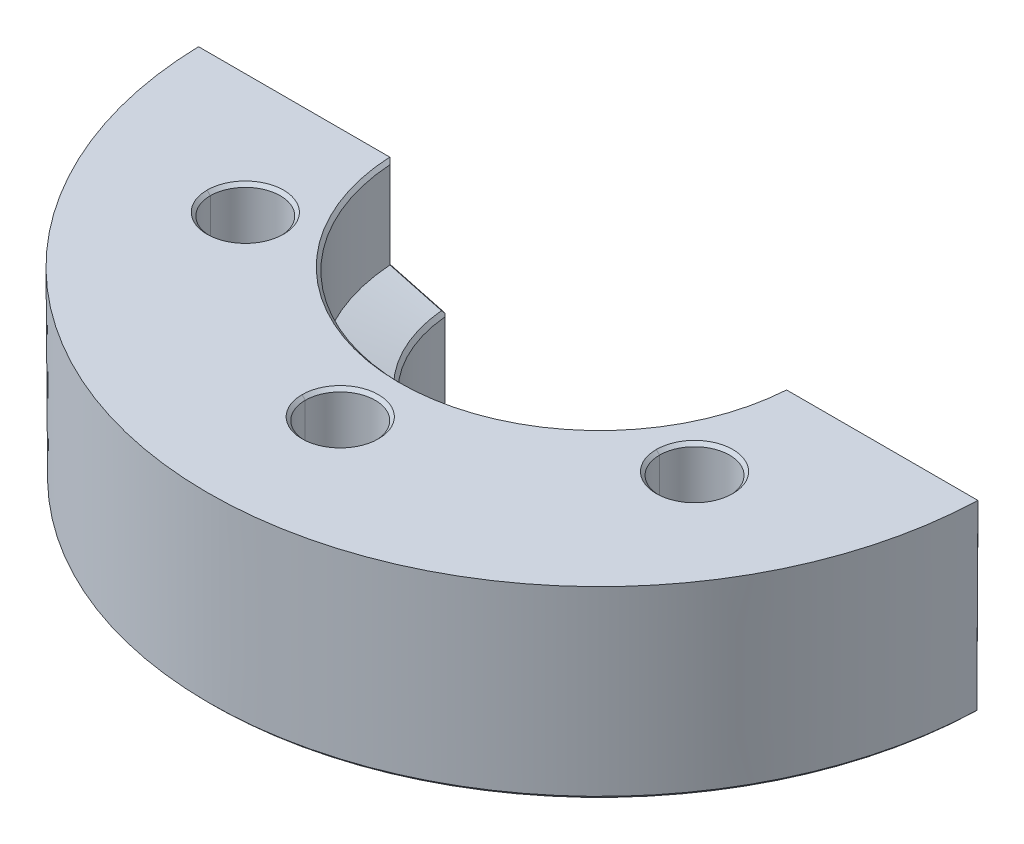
ISO-10303-21;
HEADER;
FILE_DESCRIPTION(('STEP AP214'),'2;1');
FILE_NAME('part.step','',(''),(''),'','','');
FILE_SCHEMA(('AUTOMOTIVE_DESIGN { 1 0 10303 214 1 1 1 1 }'));
ENDSEC;
DATA;
#1=APPLICATION_CONTEXT('core data for automotive mechanical design processes');
#2=APPLICATION_PROTOCOL_DEFINITION('international standard','automotive_design',2000,#1);
#3=PRODUCT_CONTEXT('',#1,'mechanical');
#4=PRODUCT('Part','Part','',(#3));
#5=PRODUCT_RELATED_PRODUCT_CATEGORY('part','',(#4));
#6=PRODUCT_DEFINITION_FORMATION('','',#4);
#7=PRODUCT_DEFINITION_CONTEXT('part definition',#1,'design');
#8=PRODUCT_DEFINITION('design','',#6,#7);
#9=PRODUCT_DEFINITION_SHAPE('','',#8);
#10=(LENGTH_UNIT() NAMED_UNIT(*) SI_UNIT(.MILLI.,.METRE.));
#11=(NAMED_UNIT(*) PLANE_ANGLE_UNIT() SI_UNIT($,.RADIAN.));
#12=(NAMED_UNIT(*) SI_UNIT($,.STERADIAN.) SOLID_ANGLE_UNIT());
#13=UNCERTAINTY_MEASURE_WITH_UNIT(LENGTH_MEASURE(1.E-05),#10,'distance_accuracy_value','');
#14=(GEOMETRIC_REPRESENTATION_CONTEXT(3) GLOBAL_UNCERTAINTY_ASSIGNED_CONTEXT((#13)) GLOBAL_UNIT_ASSIGNED_CONTEXT((#10,
#11,#12)) REPRESENTATION_CONTEXT('',''));
#15=CARTESIAN_POINT('',(0.,0.,0.));
#16=DIRECTION('',(0.,0.,1.));
#17=DIRECTION('',(1.,0.,0.));
#18=AXIS2_PLACEMENT_3D('',#15,#16,#17);
#19=CARTESIAN_POINT('',(-11.06667715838,-85.31647866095,0.849701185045));
#20=DIRECTION('',(-0.679246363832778,0.,0.73391033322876));
#21=DIRECTION('',(0.,1.,0.));
#22=AXIS2_PLACEMENT_3D('',#19,#20,#21);
#23=PLANE('',#22);
#24=CARTESIAN_POINT('',(-11.062443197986,-82.2010897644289,0.853619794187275));
#25=CARTESIAN_POINT('',(-11.0670865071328,-82.2044116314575,0.849301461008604));
#26=CARTESIAN_POINT('',(-11.0717316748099,-82.2077320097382,0.84498398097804));
#27=CARTESIAN_POINT('',(-11.0810275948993,-82.2143710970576,0.836349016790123));
#28=CARTESIAN_POINT('',(-11.0856783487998,-82.217689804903,0.832031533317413));
#29=CARTESIAN_POINT('',(-11.0949854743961,-82.2243255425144,0.82339656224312));
#30=CARTESIAN_POINT('',(-11.0996418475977,-82.2276425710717,0.819079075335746));
#31=CARTESIAN_POINT('',(-11.1089602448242,-82.2342749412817,0.810444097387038));
#32=CARTESIAN_POINT('',(-11.1136222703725,-82.2375902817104,0.806126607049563));
#33=CARTESIAN_POINT('',(-11.1229520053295,-82.2442192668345,0.797491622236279));
#34=CARTESIAN_POINT('',(-11.1276197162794,-82.2475329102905,0.793174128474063));
#35=CARTESIAN_POINT('',(-11.1369608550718,-82.2541584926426,0.784539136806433));
#36=CARTESIAN_POINT('',(-11.1416342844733,-82.2574704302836,0.780221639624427));
#37=CARTESIAN_POINT('',(-11.1509868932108,-82.2640925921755,0.77158664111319));
#38=CARTESIAN_POINT('',(-11.1556660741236,-82.2674028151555,0.767269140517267));
#39=CARTESIAN_POINT('',(-11.1650302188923,-82.2740215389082,0.758634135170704));
#40=CARTESIAN_POINT('',(-11.169715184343,-82.2773300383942,0.754316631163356));
#41=CARTESIAN_POINT('',(-11.174402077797,-82.2806369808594,0.75000002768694));
#42=B_SPLINE_CURVE_WITH_KNOTS('',3,(#24,#25,#26,#27,#28,#29,#30,#31,#32,#33,#34,#35,#36,#37,#38,
#39,#40,#41),.UNSPECIFIED.,.F.,.F.,(4,2,2,2,2,2,2,2,4),(0.,0.0214752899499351,
0.0429591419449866,0.0644516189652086,0.0859527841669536,0.107462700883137,0.128981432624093,
0.150509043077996,0.172045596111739),.UNSPECIFIED.);
#43=CARTESIAN_POINT('',(-11.06244319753,-82.20108976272,0.853619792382));
#44=VERTEX_POINT('',#43);
#45=CARTESIAN_POINT('',(-11.17440207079,-82.28063695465,0.75));
#46=VERTEX_POINT('',#45);
#47=EDGE_CURVE('E531',#44,#46,#42,.T.);
#48=ORIENTED_EDGE('',*,*,#47,.F.);
#49=CARTESIAN_POINT('',(-10.95895228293,-82.32532438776,0.94940237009));
#50=CARTESIAN_POINT('',(-11.01047448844,-82.26379349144,0.901717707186));
#51=CARTESIAN_POINT('',(-11.06244319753,-82.20108976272,0.853619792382));
#52=(BOUNDED_CURVE() B_SPLINE_CURVE(2,(#49,#50,#51),.UNSPECIFIED.,.F.,
.F.) B_SPLINE_CURVE_WITH_KNOTS((3,3),(4.439127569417E-09,0.01897948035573),
.UNSPECIFIED.) CURVE() GEOMETRIC_REPRESENTATION_ITEM() RATIONAL_B_SPLINE_CURVE((1.000000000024,
1.000050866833,1.000061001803)) REPRESENTATION_ITEM(''));
#53=CARTESIAN_POINT('',(-10.95895228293,-82.32532438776,0.94940237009));
#54=VERTEX_POINT('',#53);
#55=EDGE_CURVE('E742',#54,#44,#52,.T.);
#56=ORIENTED_EDGE('',*,*,#55,.F.);
#57=DIRECTION('',(0.,1.,0.));
#58=VECTOR('',#57,1.);
#59=CARTESIAN_POINT('',(-10.95895228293,-85.31647866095,0.94940237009));
#60=LINE('',#59,#58);
#61=CARTESIAN_POINT('',(-10.95895228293,-88.06647866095,0.94940237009));
#62=VERTEX_POINT('',#61);
#63=EDGE_CURVE('E357',#62,#54,#60,.T.);
#64=ORIENTED_EDGE('',*,*,#63,.F.);
#65=CARTESIAN_POINT('',(-11.06692118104,-88.16595399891,0.849475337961));
#66=CARTESIAN_POINT('',(-11.0126937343,-88.11572666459,0.899663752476));
#67=CARTESIAN_POINT('',(-10.95895228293,-88.06647866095,0.94940237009));
#68=(BOUNDED_CURVE() B_SPLINE_CURVE(2,(#65,#66,#67),.UNSPECIFIED.,.F.,
.F.) B_SPLINE_CURVE_WITH_KNOTS((3,3),(0.02647113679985,0.04439377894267),
.UNSPECIFIED.) CURVE() GEOMETRIC_REPRESENTATION_ITEM() RATIONAL_B_SPLINE_CURVE((1.000065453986,
1.000054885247,1.)) REPRESENTATION_ITEM(''));
#69=CARTESIAN_POINT('',(-11.06692118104,-88.16595399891,0.849475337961));
#70=VERTEX_POINT('',#69);
#71=EDGE_CURVE('E395',#70,#62,#68,.T.);
#72=ORIENTED_EDGE('',*,*,#71,.F.);
#73=DIRECTION('',(0.607102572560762,-0.56188364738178,0.56188364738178));
#74=VECTOR('',#73,1.);
#75=CARTESIAN_POINT('',(-8.587254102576,-90.4609276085,3.144448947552));
#76=LINE('',#75,#74);
#77=CARTESIAN_POINT('',(-11.17440203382,-88.06647866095,0.75));
#78=VERTEX_POINT('',#77);
#79=EDGE_CURVE('E10',#78,#70,#76,.T.);
#80=ORIENTED_EDGE('',*,*,#79,.F.);
#81=DIRECTION('',(0.,-1.,0.));
#82=VECTOR('',#81,1.);
#83=CARTESIAN_POINT('',(-11.17440203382,-85.31647866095,0.75));
#84=LINE('',#83,#82);
#85=EDGE_CURVE('E413',#46,#78,#84,.T.);
#86=ORIENTED_EDGE('',*,*,#85,.F.);
#87=EDGE_LOOP('',(#48,#56,#64,#72,#80,#86));
#88=FACE_BOUND('',#87,.T.);
#89=ADVANCED_FACE('F16',(#88),#23,.F.);
#90=CARTESIAN_POINT('',(4.978097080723,-88.19147866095,0.875));
#91=DIRECTION('',(0.,0.707106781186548,0.707106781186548));
#92=DIRECTION('',(1.,0.,0.));
#93=AXIS2_PLACEMENT_3D('',#90,#91,#92);
#94=PLANE('',#93);
#95=ORIENTED_EDGE('',*,*,#79,.T.);
#96=CARTESIAN_POINT('',(-11.06692118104,-88.16595399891,0.849475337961));
#97=CARTESIAN_POINT('',(-11.11330679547,-88.21603652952,0.899557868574));
#98=CARTESIAN_POINT('',(-11.1594893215,-88.26621465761,0.949735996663));
#99=CARTESIAN_POINT('',(-11.2054674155,-88.31647866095,1.));
#100=(BOUNDED_CURVE() B_SPLINE_CURVE(3,(#96,#97,#98,#99),.UNSPECIFIED.,.F.,
.F.) B_SPLINE_CURVE_WITH_KNOTS((4,4),(0.01683673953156,0.04223405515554),
.UNSPECIFIED.) CURVE() GEOMETRIC_REPRESENTATION_ITEM() RATIONAL_B_SPLINE_CURVE((1.,1.,1.,1.)) REPRESENTATION_ITEM(''));
#101=CARTESIAN_POINT('',(-11.2054674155,-88.31647866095,1.));
#102=VERTEX_POINT('',#101);
#103=EDGE_CURVE('E423',#70,#102,#100,.T.);
#104=ORIENTED_EDGE('',*,*,#103,.T.);
#105=DIRECTION('',(1.,0.,0.));
#106=VECTOR('',#105,1.);
#107=CARTESIAN_POINT('',(4.978097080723,-88.31647866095,1.));
#108=LINE('',#107,#106);
#109=CARTESIAN_POINT('',(-29.83324487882,-88.31647866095,1.));
#110=VERTEX_POINT('',#109);
#111=EDGE_CURVE('E481',#110,#102,#108,.T.);
#112=ORIENTED_EDGE('',*,*,#111,.F.);
#113=CARTESIAN_POINT('',(-29.83324487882,-88.31647866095,1.));
#114=CARTESIAN_POINT('',(-29.92006860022,-88.23301221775,0.916533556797));
#115=CARTESIAN_POINT('',(-30.00665933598,-88.14940725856,0.832928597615));
#116=CARTESIAN_POINT('',(-30.09218486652,-88.06648334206,0.75));
#117=(BOUNDED_CURVE() B_SPLINE_CURVE(3,(#113,#114,#115,#116),.UNSPECIFIED.,.F.,
.F.) B_SPLINE_CURVE_WITH_KNOTS((4,4),(0.,0.04395962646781),
.UNSPECIFIED.) CURVE() GEOMETRIC_REPRESENTATION_ITEM() RATIONAL_B_SPLINE_CURVE((1.,1.,1.,1.)) REPRESENTATION_ITEM(''));
#118=CARTESIAN_POINT('',(-30.09218486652,-88.06648334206,0.75));
#119=VERTEX_POINT('',#118);
#120=EDGE_CURVE('E446',#110,#119,#117,.T.);
#121=ORIENTED_EDGE('',*,*,#120,.T.);
#122=DIRECTION('',(-1.,0.,0.));
#123=VECTOR('',#122,1.);
#124=CARTESIAN_POINT('',(4.978097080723,-88.06647866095,0.75));
#125=LINE('',#124,#123);
#126=EDGE_CURVE('E29',#78,#119,#125,.T.);
#127=ORIENTED_EDGE('',*,*,#126,.F.);
#128=EDGE_LOOP('',(#95,#104,#112,#121,#127));
#129=FACE_BOUND('',#128,.T.);
#130=ADVANCED_FACE('F851',(#129),#94,.F.);
#131=CARTESIAN_POINT('',(-20.14380583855,-81.15823933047,0.75));
#132=DIRECTION('',(0.,0.,1.));
#133=DIRECTION('',(1.,0.,0.));
#134=AXIS2_PLACEMENT_3D('',#131,#132,#133);
#135=PLANE('',#134);
#136=ORIENTED_EDGE('',*,*,#85,.T.);
#137=ORIENTED_EDGE('',*,*,#126,.T.);
#138=DIRECTION('',(-0.00612141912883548,0.999981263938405,0.));
#139=VECTOR('',#138,1.);
#140=CARTESIAN_POINT('',(-30.13447391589,-81.15823933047,0.75));
#141=LINE('',#140,#139);
#142=CARTESIAN_POINT('',(-30.17829332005,-74.,0.75));
#143=VERTEX_POINT('',#142);
#144=EDGE_CURVE('E705',#119,#143,#141,.T.);
#145=ORIENTED_EDGE('',*,*,#144,.T.);
#146=DIRECTION('',(-1.,0.,0.));
#147=VECTOR('',#146,1.);
#148=CARTESIAN_POINT('',(-2.471902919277,-74.,0.75));
#149=LINE('',#148,#147);
#150=CARTESIAN_POINT('',(-15.43178537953,-74.,0.75));
#151=VERTEX_POINT('',#150);
#152=EDGE_CURVE('E439',#151,#143,#149,.T.);
#153=ORIENTED_EDGE('',*,*,#152,.F.);
#154=CARTESIAN_POINT('',(-15.43178537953,-74.,0.75));
#155=CARTESIAN_POINT('',(-15.43163540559,-74.00014979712,0.75));
#156=CARTESIAN_POINT('',(-15.43148543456,-74.00029959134,0.75));
#157=(BOUNDED_CURVE() B_SPLINE_CURVE(2,(#154,#155,#156),.UNSPECIFIED.,.F.,
.F.) B_SPLINE_CURVE_WITH_KNOTS((3,3),(7.406010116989E-05,8.480710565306E-05),
.UNSPECIFIED.) CURVE() GEOMETRIC_REPRESENTATION_ITEM() RATIONAL_B_SPLINE_CURVE((1.000079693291,
1.000085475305,1.000091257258)) REPRESENTATION_ITEM(''));
#158=CARTESIAN_POINT('',(-15.43148543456,-74.00029959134,0.75));
#159=VERTEX_POINT('',#158);
#160=EDGE_CURVE('E390',#151,#159,#157,.T.);
#161=ORIENTED_EDGE('',*,*,#160,.T.);
#162=DIRECTION('',(0.,-1.,0.));
#163=VECTOR('',#162,1.);
#164=CARTESIAN_POINT('',(-15.43148543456,-77.47496888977,0.75));
#165=LINE('',#164,#163);
#166=CARTESIAN_POINT('',(-15.43148543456,-81.14183001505,0.75));
#167=VERTEX_POINT('',#166);
#168=EDGE_CURVE('E406',#159,#167,#165,.T.);
#169=ORIENTED_EDGE('',*,*,#168,.T.);
#170=CARTESIAN_POINT('',(-15.43148543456,-81.14183001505,0.75));
#171=CARTESIAN_POINT('',(-15.36969584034,-81.15836632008,0.75));
#172=CARTESIAN_POINT('',(-15.30790624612,-81.17490262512,0.75));
#173=CARTESIAN_POINT('',(-15.2461166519,-81.19143893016,0.75));
#174=CARTESIAN_POINT('',(-13.40910137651,-81.68306612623,0.75));
#175=CARTESIAN_POINT('',(-12.17542665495,-82.01302346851,0.75));
#176=CARTESIAN_POINT('',(-11.17440207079,-82.28063695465,0.75));
#177=(BOUNDED_CURVE() B_SPLINE_CURVE(3,(#170,#171,#172,#173,#174,#175,#176),.UNSPECIFIED.,.F.,
.F.) B_SPLINE_CURVE_WITH_KNOTS((4,3,4),(-19.17807823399,-19.17242245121,-19.00427668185),
.UNSPECIFIED.) CURVE() GEOMETRIC_REPRESENTATION_ITEM() RATIONAL_B_SPLINE_CURVE((1.,1.,1.,1.,1.,
1.,1.)) REPRESENTATION_ITEM(''));
#178=EDGE_CURVE('E1089',#167,#46,#177,.T.);
#179=ORIENTED_EDGE('',*,*,#178,.T.);
#180=EDGE_LOOP('',(#136,#137,#145,#153,#161,#169,#179));
#181=FACE_BOUND('',#180,.T.);
#182=ADVANCED_FACE('F550',(#181),#135,.F.);
#183=CARTESIAN_POINT('',(-11.08975794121,-82.30326539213,0.75));
#184=CARTESIAN_POINT('',(-12.10591336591,-82.03161517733,0.75));
#185=CARTESIAN_POINT('',(-13.3569851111,-81.6970136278,0.75));
#186=CARTESIAN_POINT('',(-15.2461166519,-81.19143893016,0.75));
#187=CARTESIAN_POINT('',(-15.30790624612,-81.17490262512,0.75));
#188=CARTESIAN_POINT('',(-15.36969584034,-81.15836632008,0.75));
#189=CARTESIAN_POINT('',(-15.43148543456,-81.14183001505,0.75));
#190=CARTESIAN_POINT('',(-11.06779542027,-82.22111071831,0.83331586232));
#191=CARTESIAN_POINT('',(-12.08398250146,-81.94961379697,0.833319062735));
#192=CARTESIAN_POINT('',(-13.33508692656,-81.61516407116,0.833321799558));
#193=CARTESIAN_POINT('',(-15.22425207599,-81.10973970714,0.833324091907));
#194=CARTESIAN_POINT('',(-15.28604297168,-81.09320826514,0.833324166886));
#195=CARTESIAN_POINT('',(-15.34783383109,-81.07667668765,0.83332423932));
#196=CARTESIAN_POINT('',(-15.40962465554,-81.06014497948,0.833324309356));
#197=CARTESIAN_POINT('',(-11.04583289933,-82.13895604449,0.91663172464));
#198=CARTESIAN_POINT('',(-12.0620516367,-81.86761241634,0.91663812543));
#199=CARTESIAN_POINT('',(-13.31318874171,-81.53331451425,0.916643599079));
#200=CARTESIAN_POINT('',(-15.20238750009,-81.02804048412,0.916648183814));
#201=CARTESIAN_POINT('',(-15.26417969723,-81.01151390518,0.916648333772));
#202=CARTESIAN_POINT('',(-15.32597182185,-80.99498705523,0.916648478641));
#203=CARTESIAN_POINT('',(-15.38776387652,-80.97845994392,0.916648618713));
#204=CARTESIAN_POINT('',(-11.0238703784,-82.05680137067,0.99994758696));
#205=CARTESIAN_POINT('',(-12.04012077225,-81.78561103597,0.999957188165));
#206=CARTESIAN_POINT('',(-13.29129055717,-81.45146495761,0.999965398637));
#207=CARTESIAN_POINT('',(-15.18052292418,-80.9463412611,0.99997227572));
#208=CARTESIAN_POINT('',(-15.24231642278,-80.9298195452,0.999972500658));
#209=CARTESIAN_POINT('',(-15.3041098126,-80.9132974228,0.999972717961));
#210=CARTESIAN_POINT('',(-15.3659030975,-80.89677490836,0.999972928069));
#211=(BOUNDED_SURFACE() B_SPLINE_SURFACE(3,3,((#183,#184,#185,#186,#187,#188,#189),(#190,#191,
#192,#193,#194,#195,#196),(#197,#198,#199,#200,#201,#202,#203),(#204,#205,#206,#207,#208,#209,
#210)),.UNSPECIFIED.,.F.,.F.,.F.) B_SPLINE_SURFACE_WITH_KNOTS((4,4),(4,3,4),(0.,1.),
(18.999506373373,19.172422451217,19.178078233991),
.UNSPECIFIED.) GEOMETRIC_REPRESENTATION_ITEM() RATIONAL_B_SPLINE_SURFACE(((1.,1.,1.,1.,1.,1.,
1.),(1.,1.,1.,1.,1.,1.,1.),(1.,1.,1.,1.,1.,1.,1.),(1.,1.,1.,1.,1.,1.,1.))) REPRESENTATION_ITEM('') SURFACE());
#212=CARTESIAN_POINT('',(-15.43148543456,-81.14183001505,0.75));
#213=CARTESIAN_POINT('',(-15.38735788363,-81.10987735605,0.791656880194));
#214=CARTESIAN_POINT('',(-15.34322831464,-81.07791920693,0.833315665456));
#215=CARTESIAN_POINT('',(-15.25512921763,-81.01411039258,0.916482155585));
#216=CARTESIAN_POINT('',(-15.21112880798,-80.98223738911,0.958019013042));
#217=CARTESIAN_POINT('',(-15.16709690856,-80.95033718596,0.99958559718));
#218=(BOUNDED_CURVE() B_SPLINE_CURVE(3,(#212,#213,#214,#215,#216,#217),.UNSPECIFIED.,.F.,
.F.) B_SPLINE_CURVE_WITH_KNOTS((4,2,4),(0.,0.02057463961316,0.04107879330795),
.UNSPECIFIED.) CURVE() GEOMETRIC_REPRESENTATION_ITEM() RATIONAL_B_SPLINE_CURVE((1.,1.,1.,1.,1.,1.)) REPRESENTATION_ITEM(''));
#219=CARTESIAN_POINT('',(-15.16709690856,-80.95033718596,0.99958559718));
#220=VERTEX_POINT('',#219);
#221=EDGE_CURVE('E396',#167,#220,#218,.T.);
#222=CARTESIAN_POINT('',(-15.1670714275,-80.94993777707,0.999972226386));
#223=CARTESIAN_POINT('',(-15.16707991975,-80.95007091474,0.999843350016));
#224=CARTESIAN_POINT('',(-15.16708841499,-80.95020405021,0.999714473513));
#225=CARTESIAN_POINT('',(-15.16709690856,-80.95033718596,0.99958559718));
#226=(BOUNDED_CURVE() B_SPLINE_CURVE(3,(#222,#223,#224,#225),.UNSPECIFIED.,.F.,
.F.) B_SPLINE_CURVE_WITH_KNOTS((4,4),(-0.03600989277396,-0.03595424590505),
.UNSPECIFIED.) CURVE() GEOMETRIC_REPRESENTATION_ITEM() RATIONAL_B_SPLINE_CURVE((1.,1.,1.,1.)) REPRESENTATION_ITEM(''));
#227=CARTESIAN_POINT('',(-15.1670714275,-80.94993777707,0.999972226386));
#228=VERTEX_POINT('',#227);
#229=EDGE_CURVE('E329',#228,#220,#226,.T.);
#230=CARTESIAN_POINT('',(-11.19691953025,-82.01061962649,0.999949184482));
#231=CARTESIAN_POINT('',(-12.17980481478,-81.74830379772,0.999958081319));
#232=CARTESIAN_POINT('',(-13.39099859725,-81.42480433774,0.999965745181));
#233=CARTESIAN_POINT('',(-15.1670714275,-80.94993777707,0.999972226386));
#234=(BOUNDED_CURVE() B_SPLINE_CURVE(3,(#230,#231,#232,#233),.UNSPECIFIED.,.F.,
.F.) B_SPLINE_CURVE_WITH_KNOTS((4,4),(19.009191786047,19.172011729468),
.UNSPECIFIED.) CURVE() GEOMETRIC_REPRESENTATION_ITEM() RATIONAL_B_SPLINE_CURVE((1.,1.,1.,1.)) REPRESENTATION_ITEM(''));
#235=CARTESIAN_POINT('',(-11.19691953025,-82.01061962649,0.999949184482));
#236=VERTEX_POINT('',#235);
#237=EDGE_CURVE('E566',#236,#228,#234,.T.);
#238=CARTESIAN_POINT('',(-11.1969196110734,-82.0106199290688,0.999949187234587));
#239=CARTESIAN_POINT('',(-11.1912897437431,-82.0186797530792,0.993740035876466));
#240=CARTESIAN_POINT('',(-11.1856538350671,-82.0267379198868,0.987534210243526));
#241=CARTESIAN_POINT('',(-11.1743917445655,-82.042819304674,0.975153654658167));
#242=CARTESIAN_POINT('',(-11.1687656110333,-82.0508425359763,0.968978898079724));
#243=CARTESIAN_POINT('',(-11.1575228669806,-82.0668541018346,0.956660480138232));
#244=CARTESIAN_POINT('',(-11.1519063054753,-82.074842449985,0.950516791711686));
#245=CARTESIAN_POINT('',(-11.1406824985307,-82.0907843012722,0.938260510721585));
#246=CARTESIAN_POINT('',(-11.1350753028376,-82.0987378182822,0.932147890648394));
#247=CARTESIAN_POINT('',(-11.1238700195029,-82.1146100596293,0.919953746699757));
#248=CARTESIAN_POINT('',(-11.1182719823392,-82.1225287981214,0.913872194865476));
#249=CARTESIAN_POINT('',(-11.1070848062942,-82.138331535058,0.901740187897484));
#250=CARTESIAN_POINT('',(-11.1014957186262,-82.146215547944,0.895689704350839));
#251=CARTESIAN_POINT('',(-11.0903262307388,-82.1619488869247,0.88361983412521));
#252=CARTESIAN_POINT('',(-11.0847458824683,-82.1697982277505,0.877600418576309));
#253=CARTESIAN_POINT('',(-11.0735936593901,-82.1854622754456,0.865592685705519));
#254=CARTESIAN_POINT('',(-11.0680218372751,-82.1932769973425,0.859604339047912));
#255=CARTESIAN_POINT('',(-11.062443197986,-82.2010897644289,0.853619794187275));
#256=B_SPLINE_CURVE_WITH_KNOTS('',3,(#238,#239,#240,#241,#242,#243,#244,#245,#246,#247,#248,
#249,#250,#251,#252,#253,#254,#255),.UNSPECIFIED.,.F.,.F.,(4,2,2,2,2,2,2,2,4),(0.,
0.03488391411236,0.0696312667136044,0.104242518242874,0.138718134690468,0.173058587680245,
0.207264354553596,0.241335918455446,0.275273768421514),.UNSPECIFIED.);
#257=EDGE_CURVE('E904',#44,#236,#256,.F.);
#258=ORIENTED_EDGE('',*,*,#47,.T.);
#259=ORIENTED_EDGE('',*,*,#178,.F.);
#260=ORIENTED_EDGE('',*,*,#221,.T.);
#261=ORIENTED_EDGE('',*,*,#229,.F.);
#262=ORIENTED_EDGE('',*,*,#237,.F.);
#263=ORIENTED_EDGE('',*,*,#257,.F.);
#264=EDGE_LOOP('',(#258,#259,#260,#261,#262,#263));
#265=FACE_BOUND('',#264,.T.);
#266=ADVANCED_FACE('F537',(#265),#211,.F.);
#267=CARTESIAN_POINT('',(11.06667715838,-85.31647866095,0.849701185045));
#268=DIRECTION('',(0.679246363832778,0.,0.73391033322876));
#269=DIRECTION('',(0.,-1.,0.));
#270=AXIS2_PLACEMENT_3D('',#267,#268,#269);
#271=PLANE('',#270);
#272=DIRECTION('',(0.607102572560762,0.56188364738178,-0.56188364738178));
#273=VECTOR('',#272,1.);
#274=CARTESIAN_POINT('',(10.422048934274,-88.76279411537,1.446315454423));
#275=LINE('',#274,#273);
#276=CARTESIAN_POINT('',(11.066921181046,-88.16595399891,0.849475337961));
#277=VERTEX_POINT('',#276);
#278=CARTESIAN_POINT('',(11.174402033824,-88.06647866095,0.75));
#279=VERTEX_POINT('',#278);
#280=EDGE_CURVE('E360',#277,#279,#275,.T.);
#281=ORIENTED_EDGE('',*,*,#280,.F.);
#282=CARTESIAN_POINT('',(10.958952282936,-88.06647866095,0.94940237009));
#283=CARTESIAN_POINT('',(11.012693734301,-88.11572666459,0.899663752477));
#284=CARTESIAN_POINT('',(11.066921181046,-88.16595399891,0.849475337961));
#285=(BOUNDED_CURVE() B_SPLINE_CURVE(2,(#282,#283,#284),.UNSPECIFIED.,.F.,
.F.) B_SPLINE_CURVE_WITH_KNOTS((3,3),(0.,0.01792264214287),
.UNSPECIFIED.) CURVE() GEOMETRIC_REPRESENTATION_ITEM() RATIONAL_B_SPLINE_CURVE((1.,
1.000054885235,1.000065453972)) REPRESENTATION_ITEM(''));
#286=CARTESIAN_POINT('',(10.958952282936,-88.06647866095,0.94940237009));
#287=VERTEX_POINT('',#286);
#288=EDGE_CURVE('E259',#287,#277,#285,.T.);
#289=ORIENTED_EDGE('',*,*,#288,.F.);
#290=DIRECTION('',(0.,-1.,0.));
#291=VECTOR('',#290,1.);
#292=CARTESIAN_POINT('',(10.958952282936,-85.31647866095,0.94940237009));
#293=LINE('',#292,#291);
#294=CARTESIAN_POINT('',(10.958952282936,-82.32532438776,0.94940237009));
#295=VERTEX_POINT('',#294);
#296=EDGE_CURVE('E356',#295,#287,#293,.T.);
#297=ORIENTED_EDGE('',*,*,#296,.F.);
#298=CARTESIAN_POINT('',(11.062443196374,-82.20108976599,0.853619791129));
#299=CARTESIAN_POINT('',(11.010474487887,-82.26379349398,0.901717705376));
#300=CARTESIAN_POINT('',(10.958952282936,-82.32532438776,0.94940237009));
#301=(BOUNDED_CURVE() B_SPLINE_CURVE(2,(#298,#299,#300),.UNSPECIFIED.,.F.,
.F.) B_SPLINE_CURVE_WITH_KNOTS((3,3),(0.0284244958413,0.0474039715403),
.UNSPECIFIED.) CURVE() GEOMETRIC_REPRESENTATION_ITEM() RATIONAL_B_SPLINE_CURVE((1.000061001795,
1.000050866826,1.000000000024)) REPRESENTATION_ITEM(''));
#302=CARTESIAN_POINT('',(11.062443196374,-82.20108976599,0.853619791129));
#303=VERTEX_POINT('',#302);
#304=EDGE_CURVE('E248',#303,#295,#301,.T.);
#305=ORIENTED_EDGE('',*,*,#304,.F.);
#306=CARTESIAN_POINT('',(11.1744020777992,-82.2806369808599,0.750000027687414));
#307=CARTESIAN_POINT('',(11.1697151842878,-82.2773300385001,0.754316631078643));
#308=CARTESIAN_POINT('',(11.1650302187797,-82.2740215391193,0.758634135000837));
#309=CARTESIAN_POINT('',(11.1556660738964,-82.2674028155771,0.767269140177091));
#310=CARTESIAN_POINT('',(11.1509868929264,-82.2640925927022,0.77158664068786));
#311=CARTESIAN_POINT('',(11.1416342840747,-82.2574704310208,0.7802216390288));
#312=CARTESIAN_POINT('',(11.1369608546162,-82.2541584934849,0.784539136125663));
#313=CARTESIAN_POINT('',(11.1276197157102,-82.2475329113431,0.793174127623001));
#314=CARTESIAN_POINT('',(11.1229520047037,-82.2442192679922,0.797491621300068));
#315=CARTESIAN_POINT('',(11.1136222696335,-82.2375902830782,0.806126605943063));
#316=CARTESIAN_POINT('',(11.1089602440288,-82.2342749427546,0.810444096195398));
#317=CARTESIAN_POINT('',(11.0996418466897,-82.2276425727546,0.819079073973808));
#318=CARTESIAN_POINT('',(11.0949854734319,-82.2243255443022,0.823396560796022));
#319=CARTESIAN_POINT('',(11.0856783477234,-82.2176898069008,0.832031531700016));
#320=CARTESIAN_POINT('',(11.081027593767,-82.2143710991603,0.836349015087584));
#321=CARTESIAN_POINT('',(11.0717316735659,-82.2077320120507,0.844983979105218));
#322=CARTESIAN_POINT('',(11.067086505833,-82.2044116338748,0.849301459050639));
#323=CARTESIAN_POINT('',(11.0624431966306,-82.201089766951,0.853619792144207));
#324=B_SPLINE_CURVE_WITH_KNOTS('',3,(#306,#307,#308,#309,#310,#311,#312,#313,#314,#315,#316,
#317,#318,#319,#320,#321,#322,#323),.UNSPECIFIED.,.F.,.F.,(4,2,2,2,2,2,2,2,4),(0.,
0.0215365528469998,0.0430641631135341,0.0645828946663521,0.0860928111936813,0.107593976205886,
0.129086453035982,0.150570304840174,0.172045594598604),.UNSPECIFIED.);
#325=CARTESIAN_POINT('',(11.174402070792,-82.28063695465,0.75));
#326=VERTEX_POINT('',#325);
#327=EDGE_CURVE('E231',#326,#303,#324,.T.);
#328=ORIENTED_EDGE('',*,*,#327,.F.);
#329=DIRECTION('',(0.,1.,0.));
#330=VECTOR('',#329,1.);
#331=CARTESIAN_POINT('',(11.174402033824,-85.31647866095,0.75));
#332=LINE('',#331,#330);
#333=EDGE_CURVE('E218',#279,#326,#332,.T.);
#334=ORIENTED_EDGE('',*,*,#333,.F.);
#335=EDGE_LOOP('',(#281,#289,#297,#305,#328,#334));
#336=FACE_BOUND('',#335,.T.);
#337=ADVANCED_FACE('F549',(#336),#271,.F.);
#338=CARTESIAN_POINT('',(-20.14380583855,-81.15823933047,0.75));
#339=DIRECTION('',(0.,0.,1.));
#340=DIRECTION('',(1.,0.,0.));
#341=AXIS2_PLACEMENT_3D('',#338,#339,#340);
#342=PLANE('',#341);
#343=ORIENTED_EDGE('',*,*,#333,.T.);
#344=CARTESIAN_POINT('',(11.174402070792,-82.28063695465,0.75));
#345=CARTESIAN_POINT('',(12.175426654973,-82.01302346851,0.75));
#346=CARTESIAN_POINT('',(13.409101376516,-81.68306612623,0.75));
#347=CARTESIAN_POINT('',(15.246116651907,-81.19143893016,0.75));
#348=CARTESIAN_POINT('',(15.307906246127,-81.17490262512,0.75));
#349=CARTESIAN_POINT('',(15.369695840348,-81.15836632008,0.75));
#350=CARTESIAN_POINT('',(15.431485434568,-81.14183001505,0.75));
#351=(BOUNDED_CURVE() B_SPLINE_CURVE(3,(#344,#345,#346,#347,#348,#349,#350),.UNSPECIFIED.,.F.,
.F.) B_SPLINE_CURVE_WITH_KNOTS((4,3,4),(19.004276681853,19.172422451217,19.178078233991),
.UNSPECIFIED.) CURVE() GEOMETRIC_REPRESENTATION_ITEM() RATIONAL_B_SPLINE_CURVE((1.,1.,1.,1.,1.,
1.,1.)) REPRESENTATION_ITEM(''));
#352=CARTESIAN_POINT('',(15.431485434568,-81.14183001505,0.75));
#353=VERTEX_POINT('',#352);
#354=EDGE_CURVE('E283',#326,#353,#351,.T.);
#355=ORIENTED_EDGE('',*,*,#354,.T.);
#356=DIRECTION('',(0.,1.,0.));
#357=VECTOR('',#356,1.);
#358=CARTESIAN_POINT('',(15.431485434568,-77.47496888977,0.75));
#359=LINE('',#358,#357);
#360=CARTESIAN_POINT('',(15.431485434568,-74.25,0.75));
#361=VERTEX_POINT('',#360);
#362=EDGE_CURVE('E306',#353,#361,#359,.T.);
#363=ORIENTED_EDGE('',*,*,#362,.T.);
#364=DIRECTION('',(1.,0.,0.));
#365=VECTOR('',#364,1.);
#366=CARTESIAN_POINT('',(-2.471902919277,-74.25,0.75));
#367=LINE('',#366,#365);
#368=CARTESIAN_POINT('',(29.926758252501,-74.25,0.75));
#369=VERTEX_POINT('',#368);
#370=EDGE_CURVE('E300',#361,#369,#367,.T.);
#371=ORIENTED_EDGE('',*,*,#370,.T.);
#372=CARTESIAN_POINT('',(29.926758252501,-74.25,0.75));
#373=CARTESIAN_POINT('',(29.898565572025,-78.85549288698,0.75));
#374=CARTESIAN_POINT('',(29.870372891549,-83.46098577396,0.75));
#375=CARTESIAN_POINT('',(29.842180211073,-88.06647866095,0.75));
#376=(BOUNDED_CURVE() B_SPLINE_CURVE(3,(#372,#373,#374,#375),.UNSPECIFIED.,.F.,
.F.) B_SPLINE_CURVE_WITH_KNOTS((4,4),(-0.690683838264,0.690989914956),
.UNSPECIFIED.) CURVE() GEOMETRIC_REPRESENTATION_ITEM() RATIONAL_B_SPLINE_CURVE((1.,1.,1.,1.)) REPRESENTATION_ITEM(''));
#377=CARTESIAN_POINT('',(29.842180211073,-88.06647866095,0.75));
#378=VERTEX_POINT('',#377);
#379=EDGE_CURVE('E304',#369,#378,#376,.T.);
#380=ORIENTED_EDGE('',*,*,#379,.T.);
#381=DIRECTION('',(-1.,0.,0.));
#382=VECTOR('',#381,1.);
#383=CARTESIAN_POINT('',(4.978097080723,-88.06647866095,0.75));
#384=LINE('',#383,#382);
#385=EDGE_CURVE('E358',#378,#279,#384,.T.);
#386=ORIENTED_EDGE('',*,*,#385,.T.);
#387=EDGE_LOOP('',(#343,#355,#363,#371,#380,#386));
#388=FACE_BOUND('',#387,.T.);
#389=ADVANCED_FACE('F302',(#388),#342,.F.);
#390=CARTESIAN_POINT('',(4.978097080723,-88.19147866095,0.875));
#391=DIRECTION('',(0.,0.707106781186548,0.707106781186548));
#392=DIRECTION('',(1.,0.,0.));
#393=AXIS2_PLACEMENT_3D('',#390,#391,#392);
#394=PLANE('',#393);
#395=ORIENTED_EDGE('',*,*,#280,.T.);
#396=ORIENTED_EDGE('',*,*,#385,.F.);
#397=DIRECTION('',(0.025264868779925,0.70688106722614,-0.70688106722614));
#398=VECTOR('',#397,1.);
#399=CARTESIAN_POINT('',(29.833244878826,-88.31647866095,1.));
#400=LINE('',#399,#398);
#401=CARTESIAN_POINT('',(29.833244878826,-88.31647866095,1.));
#402=VERTEX_POINT('',#401);
#403=EDGE_CURVE('E667',#402,#378,#400,.T.);
#404=ORIENTED_EDGE('',*,*,#403,.F.);
#405=DIRECTION('',(1.,0.,0.));
#406=VECTOR('',#405,1.);
#407=CARTESIAN_POINT('',(4.978097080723,-88.31647866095,1.));
#408=LINE('',#407,#406);
#409=CARTESIAN_POINT('',(11.205467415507,-88.31647866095,1.));
#410=VERTEX_POINT('',#409);
#411=EDGE_CURVE('E445',#410,#402,#408,.T.);
#412=ORIENTED_EDGE('',*,*,#411,.F.);
#413=CARTESIAN_POINT('',(11.205467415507,-88.31647866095,1.));
#414=CARTESIAN_POINT('',(11.159489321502,-88.26621465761,0.949735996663));
#415=CARTESIAN_POINT('',(11.113306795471,-88.21603652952,0.899557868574));
#416=CARTESIAN_POINT('',(11.066921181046,-88.16595399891,0.849475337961));
#417=(BOUNDED_CURVE() B_SPLINE_CURVE(3,(#413,#414,#415,#416),.UNSPECIFIED.,.F.,
.F.) B_SPLINE_CURVE_WITH_KNOTS((4,4),(0.,0.02539730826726),
.UNSPECIFIED.) CURVE() GEOMETRIC_REPRESENTATION_ITEM() RATIONAL_B_SPLINE_CURVE((1.,1.,1.,1.)) REPRESENTATION_ITEM(''));
#418=EDGE_CURVE('E519',#410,#277,#417,.T.);
#419=ORIENTED_EDGE('',*,*,#418,.T.);
#420=EDGE_LOOP('',(#395,#396,#404,#412,#419));
#421=FACE_BOUND('',#420,.T.);
#422=ADVANCED_FACE('F1008',(#421),#394,.F.);
#423=CARTESIAN_POINT('',(0.,-88.19147866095,0.));
#424=DIRECTION('',(0.,-1.,0.));
#425=DIRECTION('',(1.,0.,0.));
#426=AXIS2_PLACEMENT_3D('',#423,#424,#425);
#427=CONICAL_SURFACE('',#426,11.125,0.785398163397);
#428=ORIENTED_EDGE('',*,*,#71,.T.);
#429=CARTESIAN_POINT('',(0.,-88.06647866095,0.));
#430=DIRECTION('',(0.,-1.,0.));
#431=DIRECTION('',(1.,0.,0.));
#432=AXIS2_PLACEMENT_3D('',#429,#430,#431);
#433=CIRCLE('',#432,11.);
#434=EDGE_CURVE('E432',#287,#62,#433,.T.);
#435=ORIENTED_EDGE('',*,*,#434,.F.);
#436=ORIENTED_EDGE('',*,*,#288,.T.);
#437=ORIENTED_EDGE('',*,*,#418,.F.);
#438=CARTESIAN_POINT('',(0.,-88.31647866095,0.));
#439=DIRECTION('',(0.,1.,0.));
#440=DIRECTION('',(1.,0.,0.));
#441=AXIS2_PLACEMENT_3D('',#438,#439,#440);
#442=CIRCLE('',#441,11.25);
#443=EDGE_CURVE('E474',#102,#410,#442,.T.);
#444=ORIENTED_EDGE('',*,*,#443,.F.);
#445=ORIENTED_EDGE('',*,*,#103,.F.);
#446=EDGE_LOOP('',(#428,#435,#436,#437,#444,#445));
#447=FACE_BOUND('',#446,.T.);
#448=ADVANCED_FACE('F551',(#447),#427,.F.);
#449=CARTESIAN_POINT('',(0.,-74.125,0.));
#450=DIRECTION('',(0.,1.,0.));
#451=DIRECTION('',(-1.,0.,0.));
#452=AXIS2_PLACEMENT_3D('',#449,#450,#451);
#453=CONICAL_SURFACE('',#452,15.325,0.785398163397);
#454=CARTESIAN_POINT('',(15.299562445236,-74.12546328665,0.874536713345));
#455=CARTESIAN_POINT('',(15.233059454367,-74.18827521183,0.937316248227));
#456=CARTESIAN_POINT('',(15.167096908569,-74.25,0.99958559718));
#457=(BOUNDED_CURVE() B_SPLINE_CURVE(2,(#454,#455,#456),.UNSPECIFIED.,.F.,
.F.) B_SPLINE_CURVE_WITH_KNOTS((3,3),(0.02189851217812,0.04408714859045),
.UNSPECIFIED.) CURVE() GEOMETRIC_REPRESENTATION_ITEM() RATIONAL_B_SPLINE_CURVE((1.000035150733,
1.000035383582,1.)) REPRESENTATION_ITEM(''));
#458=CARTESIAN_POINT('',(15.299562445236,-74.12546328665,0.874536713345));
#459=VERTEX_POINT('',#458);
#460=CARTESIAN_POINT('',(15.167096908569,-74.25,0.99958559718));
#461=VERTEX_POINT('',#460);
#462=EDGE_CURVE('E181',#459,#461,#457,.T.);
#463=ORIENTED_EDGE('',*,*,#462,.T.);
#464=CARTESIAN_POINT('',(0.,-74.25,0.));
#465=DIRECTION('',(0.,1.,0.));
#466=DIRECTION('',(-1.,0.,0.));
#467=AXIS2_PLACEMENT_3D('',#464,#465,#466);
#468=CIRCLE('',#467,15.2);
#469=CARTESIAN_POINT('',(-15.16709690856,-74.25,0.99958559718));
#470=VERTEX_POINT('',#469);
#471=EDGE_CURVE('E384',#470,#461,#468,.T.);
#472=ORIENTED_EDGE('',*,*,#471,.F.);
#473=CARTESIAN_POINT('',(-15.16709690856,-74.25,0.99958559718));
#474=CARTESIAN_POINT('',(-15.25547674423,-74.16729811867,0.916154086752));
#475=CARTESIAN_POINT('',(-15.34362149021,-74.08403343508,0.832944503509));
#476=CARTESIAN_POINT('',(-15.43148543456,-74.00029959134,0.75));
#477=(BOUNDED_CURVE() B_SPLINE_CURVE(3,(#473,#474,#475,#476),.UNSPECIFIED.,.F.,
.F.) B_SPLINE_CURVE_WITH_KNOTS((4,4),(0.,0.04410246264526),
.UNSPECIFIED.) CURVE() GEOMETRIC_REPRESENTATION_ITEM() RATIONAL_B_SPLINE_CURVE((1.,1.,1.,1.)) REPRESENTATION_ITEM(''));
#478=EDGE_CURVE('E410',#470,#159,#477,.T.);
#479=ORIENTED_EDGE('',*,*,#478,.T.);
#480=ORIENTED_EDGE('',*,*,#160,.F.);
#481=CARTESIAN_POINT('',(0.,-74.,0.));
#482=DIRECTION('',(0.,-1.,0.));
#483=DIRECTION('',(-1.,0.,0.));
#484=AXIS2_PLACEMENT_3D('',#481,#482,#483);
#485=CIRCLE('',#484,15.45);
#486=CARTESIAN_POINT('',(15.417603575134,-74.,1.));
#487=VERTEX_POINT('',#486);
#488=EDGE_CURVE('E165',#487,#151,#485,.T.);
#489=ORIENTED_EDGE('',*,*,#488,.F.);
#490=CARTESIAN_POINT('',(15.299562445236,-74.12546328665,0.874536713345));
#491=CARTESIAN_POINT('',(15.358583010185,-74.06297271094,0.937027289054));
#492=CARTESIAN_POINT('',(15.417603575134,-74.,1.));
#493=(BOUNDED_CURVE() B_SPLINE_CURVE(2,(#490,#491,#492),.UNSPECIFIED.,.F.,
.F.) B_SPLINE_CURVE_WITH_KNOTS((3,3),(0.02126072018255,0.0425149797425),
.UNSPECIFIED.) CURVE() GEOMETRIC_REPRESENTATION_ITEM() RATIONAL_B_SPLINE_CURVE((1.,1.,1.)) REPRESENTATION_ITEM(''));
#494=EDGE_CURVE('E661',#459,#487,#493,.T.);
#495=ORIENTED_EDGE('',*,*,#494,.F.);
#496=EDGE_LOOP('',(#463,#472,#479,#480,#489,#495));
#497=FACE_BOUND('',#496,.T.);
#498=ADVANCED_FACE('F1000',(#497),#453,.F.);
#499=CARTESIAN_POINT('',(-15.29929117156,-77.47496888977,0.87479279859));
#500=DIRECTION('',(-0.686456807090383,0.,0.727170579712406));
#501=DIRECTION('',(0.,1.,0.));
#502=AXIS2_PLACEMENT_3D('',#499,#500,#501);
#503=PLANE('',#502);
#504=ORIENTED_EDGE('',*,*,#168,.F.);
#505=ORIENTED_EDGE('',*,*,#478,.F.);
#506=DIRECTION('',(0.,1.,0.));
#507=VECTOR('',#506,1.);
#508=CARTESIAN_POINT('',(-15.16709690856,-77.47496888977,0.99958559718));
#509=LINE('',#508,#507);
#510=EDGE_CURVE('E389',#220,#470,#509,.T.);
#511=ORIENTED_EDGE('',*,*,#510,.F.);
#512=ORIENTED_EDGE('',*,*,#221,.F.);
#513=EDGE_LOOP('',(#504,#505,#511,#512));
#514=FACE_BOUND('',#513,.T.);
#515=ADVANCED_FACE('F869',(#514),#503,.F.);
#516=CARTESIAN_POINT('',(15.431485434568,-81.14183001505,0.75));
#517=CARTESIAN_POINT('',(15.369695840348,-81.15836632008,0.75));
#518=CARTESIAN_POINT('',(15.307906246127,-81.17490262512,0.75));
#519=CARTESIAN_POINT('',(15.246116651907,-81.19143893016,0.75));
#520=CARTESIAN_POINT('',(13.35698511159,-81.69701362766,0.75));
#521=CARTESIAN_POINT('',(12.105913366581,-82.03161517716,0.75));
#522=CARTESIAN_POINT('',(11.089757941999,-82.30326539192,0.75));
#523=CARTESIAN_POINT('',(15.409624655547,-81.06014497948,0.833324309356));
#524=CARTESIAN_POINT('',(15.347833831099,-81.07667668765,0.83332423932));
#525=CARTESIAN_POINT('',(15.28604297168,-81.09320826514,0.833324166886));
#526=CARTESIAN_POINT('',(15.224252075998,-81.10973970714,0.833324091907));
#527=CARTESIAN_POINT('',(13.33508692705,-81.61516407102,0.833321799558));
#528=CARTESIAN_POINT('',(12.083982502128,-81.94961379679,0.833319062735));
#529=CARTESIAN_POINT('',(11.067795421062,-82.2211107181,0.83331586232));
#530=CARTESIAN_POINT('',(15.387763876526,-80.97845994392,0.916648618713));
#531=CARTESIAN_POINT('',(15.325971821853,-80.99498705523,0.916648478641));
#532=CARTESIAN_POINT('',(15.264179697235,-81.01151390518,0.916648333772));
#533=CARTESIAN_POINT('',(15.20238750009,-81.02804048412,0.916648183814));
#534=CARTESIAN_POINT('',(13.313188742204,-81.53331451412,0.916643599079));
#535=CARTESIAN_POINT('',(12.062051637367,-81.86761241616,0.91663812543));
#536=CARTESIAN_POINT('',(11.045832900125,-82.13895604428,0.91663172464));
#537=CARTESIAN_POINT('',(15.365903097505,-80.89677490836,0.999972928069));
#538=CARTESIAN_POINT('',(15.304109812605,-80.9132974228,0.999972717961));
#539=CARTESIAN_POINT('',(15.242316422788,-80.9298195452,0.999972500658));
#540=CARTESIAN_POINT('',(15.180522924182,-80.9463412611,0.99997227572));
#541=CARTESIAN_POINT('',(13.291290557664,-81.45146495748,0.999965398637));
#542=CARTESIAN_POINT('',(12.040120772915,-81.78561103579,0.999957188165));
#543=CARTESIAN_POINT('',(11.023870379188,-82.05680137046,0.99994758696));
#544=(BOUNDED_SURFACE() B_SPLINE_SURFACE(3,3,((#516,#517,#518,#519,#520,#521,#522),(#523,#524,
#525,#526,#527,#528,#529),(#530,#531,#532,#533,#534,#535,#536),(#537,#538,#539,#540,#541,#542,
#543)),.UNSPECIFIED.,.F.,.F.,.F.) B_SPLINE_SURFACE_WITH_KNOTS((4,4),(4,3,4),(0.,1.),
(-19.17807823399,-19.17242245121,-18.99950637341),
.UNSPECIFIED.) GEOMETRIC_REPRESENTATION_ITEM() RATIONAL_B_SPLINE_SURFACE(((1.,1.,1.,1.,1.,1.,
1.),(1.,1.,1.,1.,1.,1.,1.),(1.,1.,1.,1.,1.,1.,1.),(1.,1.,1.,1.,1.,1.,1.))) REPRESENTATION_ITEM('') SURFACE());
#545=CARTESIAN_POINT('',(11.0624431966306,-82.201089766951,0.853619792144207));
#546=CARTESIAN_POINT('',(11.0680218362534,-82.1932769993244,0.859604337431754));
#547=CARTESIAN_POINT('',(11.0735936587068,-82.1854622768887,0.865592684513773));
#548=CARTESIAN_POINT('',(11.0847458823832,-82.1697982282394,0.87760041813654));
#549=CARTESIAN_POINT('',(11.0903262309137,-82.1619488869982,0.883619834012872));
#550=CARTESIAN_POINT('',(11.1014957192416,-82.1462155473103,0.895689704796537));
#551=CARTESIAN_POINT('',(11.1070848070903,-82.1383315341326,0.901740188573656));
#552=CARTESIAN_POINT('',(11.1182719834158,-82.1225287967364,0.913872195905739));
#553=CARTESIAN_POINT('',(11.1238700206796,-82.1146100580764,0.919953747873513));
#554=CARTESIAN_POINT('',(11.1350753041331,-82.098737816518,0.93214789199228));
#555=CARTESIAN_POINT('',(11.1406824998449,-82.0907842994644,0.938260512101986));
#556=CARTESIAN_POINT('',(11.1519063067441,-82.0748424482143,0.950516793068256));
#557=CARTESIAN_POINT('',(11.1575228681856,-82.0668541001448,0.956660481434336));
#558=CARTESIAN_POINT('',(11.1687656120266,-82.0508425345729,0.968978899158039));
#559=CARTESIAN_POINT('',(11.1743917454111,-82.0428193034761,0.975153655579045));
#560=CARTESIAN_POINT('',(11.1856538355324,-82.026737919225,0.987534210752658));
#561=CARTESIAN_POINT('',(11.191289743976,-82.0186797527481,0.99374003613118));
#562=CARTESIAN_POINT('',(11.1969196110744,-82.0106199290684,0.99994918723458));
#563=B_SPLINE_CURVE_WITH_KNOTS('',3,(#545,#546,#547,#548,#549,#550,#551,#552,#553,#554,#555,
#556,#557,#558,#559,#560,#561,#562),.UNSPECIFIED.,.F.,.F.,(4,2,2,2,2,2,2,2,4),(0.,
0.0339378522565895,0.0680094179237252,0.102215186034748,0.13655563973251,0.171031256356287,
0.205642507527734,0.24038985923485,0.275273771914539),.UNSPECIFIED.);
#564=CARTESIAN_POINT('',(11.196919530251,-82.01061962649,0.999949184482));
#565=VERTEX_POINT('',#564);
#566=EDGE_CURVE('E275',#565,#303,#563,.F.);
#567=CARTESIAN_POINT('',(15.167071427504,-80.94993777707,0.999972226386));
#568=CARTESIAN_POINT('',(13.390998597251,-81.42480433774,0.999965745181));
#569=CARTESIAN_POINT('',(12.1798048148,-81.74830379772,0.999958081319));
#570=CARTESIAN_POINT('',(11.196919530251,-82.01061962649,0.999949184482));
#571=(BOUNDED_CURVE() B_SPLINE_CURVE(3,(#567,#568,#569,#570),.UNSPECIFIED.,.F.,
.F.) B_SPLINE_CURVE_WITH_KNOTS((4,4),(-19.17201172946,-19.00919178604),
.UNSPECIFIED.) CURVE() GEOMETRIC_REPRESENTATION_ITEM() RATIONAL_B_SPLINE_CURVE((1.,1.,1.,1.)) REPRESENTATION_ITEM(''));
#572=CARTESIAN_POINT('',(15.167071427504,-80.94993777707,0.999972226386));
#573=VERTEX_POINT('',#572);
#574=EDGE_CURVE('E573',#573,#565,#571,.T.);
#575=CARTESIAN_POINT('',(15.167096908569,-80.95033718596,0.99958559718));
#576=CARTESIAN_POINT('',(15.16708841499,-80.95020405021,0.999714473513));
#577=CARTESIAN_POINT('',(15.167079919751,-80.95007091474,0.999843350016));
#578=CARTESIAN_POINT('',(15.167071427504,-80.94993777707,0.999972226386));
#579=(BOUNDED_CURVE() B_SPLINE_CURVE(3,(#575,#576,#577,#578),.UNSPECIFIED.,.F.,
.F.) B_SPLINE_CURVE_WITH_KNOTS((4,4),(-5.5646866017E-05,0.),
.UNSPECIFIED.) CURVE() GEOMETRIC_REPRESENTATION_ITEM() RATIONAL_B_SPLINE_CURVE((1.,1.,1.,1.)) REPRESENTATION_ITEM(''));
#580=CARTESIAN_POINT('',(15.167096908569,-80.95033718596,0.99958559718));
#581=VERTEX_POINT('',#580);
#582=EDGE_CURVE('E468',#581,#573,#579,.T.);
#583=CARTESIAN_POINT('',(15.431485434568,-81.14183001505,0.75));
#584=CARTESIAN_POINT('',(15.387483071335,-81.10996800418,0.791538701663));
#585=CARTESIAN_POINT('',(15.343478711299,-81.07810054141,0.833079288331));
#586=CARTESIAN_POINT('',(15.255379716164,-81.0142918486,0.91624568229));
#587=CARTESIAN_POINT('',(15.211254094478,-80.98232815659,0.957900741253));
#588=CARTESIAN_POINT('',(15.167096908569,-80.95033718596,0.99958559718));
#589=(BOUNDED_CURVE() B_SPLINE_CURVE(3,(#583,#584,#585,#586,#587,#588),.UNSPECIFIED.,.F.,
.F.) B_SPLINE_CURVE_WITH_KNOTS((4,2,4),(-0.04113536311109,-0.02059081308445,0.),
.UNSPECIFIED.) CURVE() GEOMETRIC_REPRESENTATION_ITEM() RATIONAL_B_SPLINE_CURVE((1.,1.,1.,1.,1.,1.)) REPRESENTATION_ITEM(''));
#590=EDGE_CURVE('E737',#353,#581,#589,.T.);
#591=ORIENTED_EDGE('',*,*,#327,.T.);
#592=ORIENTED_EDGE('',*,*,#566,.F.);
#593=ORIENTED_EDGE('',*,*,#574,.F.);
#594=ORIENTED_EDGE('',*,*,#582,.F.);
#595=ORIENTED_EDGE('',*,*,#590,.F.);
#596=ORIENTED_EDGE('',*,*,#354,.F.);
#597=EDGE_LOOP('',(#591,#592,#593,#594,#595,#596));
#598=FACE_BOUND('',#597,.T.);
#599=ADVANCED_FACE('F862',(#598),#544,.F.);
#600=CARTESIAN_POINT('',(0.,-82.16797200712,0.));
#601=DIRECTION('',(0.,1.,0.));
#602=DIRECTION('',(1.,0.,0.));
#603=AXIS2_PLACEMENT_3D('',#600,#601,#602);
#604=CONICAL_SURFACE('',#603,11.120740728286,0.654498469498);
#605=ORIENTED_EDGE('',*,*,#55,.T.);
#606=ORIENTED_EDGE('',*,*,#257,.T.);
#607=CARTESIAN_POINT('',(0.,-82.01061962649,0.));
#608=DIRECTION('',(0.,-1.,0.));
#609=DIRECTION('',(1.,0.,0.));
#610=AXIS2_PLACEMENT_3D('',#607,#608,#609);
#611=CIRCLE('',#610,11.241481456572);
#612=EDGE_CURVE('E505',#565,#236,#611,.T.);
#613=ORIENTED_EDGE('',*,*,#612,.F.);
#614=ORIENTED_EDGE('',*,*,#566,.T.);
#615=ORIENTED_EDGE('',*,*,#304,.T.);
#616=CARTESIAN_POINT('',(0.,-82.32532438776,0.));
#617=DIRECTION('',(0.,1.,0.));
#618=DIRECTION('',(1.,0.,0.));
#619=AXIS2_PLACEMENT_3D('',#616,#617,#618);
#620=CIRCLE('',#619,11.);
#621=EDGE_CURVE('E352',#54,#295,#620,.T.);
#622=ORIENTED_EDGE('',*,*,#621,.F.);
#623=EDGE_LOOP('',(#605,#606,#613,#614,#615,#622));
#624=FACE_BOUND('',#623,.T.);
#625=ADVANCED_FACE('F868',(#624),#604,.F.);
#626=CARTESIAN_POINT('',(15.299291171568,-77.47496888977,0.87479279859));
#627=DIRECTION('',(0.686456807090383,0.,0.727170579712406));
#628=DIRECTION('',(0.,-1.,0.));
#629=AXIS2_PLACEMENT_3D('',#626,#627,#628);
#630=PLANE('',#629);
#631=ORIENTED_EDGE('',*,*,#462,.F.);
#632=DIRECTION('',(-0.599510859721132,0.565944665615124,0.565944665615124));
#633=VECTOR('',#632,1.);
#634=CARTESIAN_POINT('',(12.673889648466,-71.64680007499,3.353199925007));
#635=LINE('',#634,#633);
#636=EDGE_CURVE('E309',#361,#459,#635,.T.);
#637=ORIENTED_EDGE('',*,*,#636,.F.);
#638=ORIENTED_EDGE('',*,*,#362,.F.);
#639=ORIENTED_EDGE('',*,*,#590,.T.);
#640=DIRECTION('',(0.,-1.,0.));
#641=VECTOR('',#640,1.);
#642=CARTESIAN_POINT('',(15.167096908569,-77.47496888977,0.99958559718));
#643=LINE('',#642,#641);
#644=EDGE_CURVE('E388',#461,#581,#643,.T.);
#645=ORIENTED_EDGE('',*,*,#644,.F.);
#646=EDGE_LOOP('',(#631,#637,#638,#639,#645));
#647=FACE_BOUND('',#646,.T.);
#648=ADVANCED_FACE('F870',(#647),#630,.F.);
#649=CARTESIAN_POINT('',(0.,-81.63320822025,0.));
#650=DIRECTION('',(0.,1.,0.));
#651=DIRECTION('',(1.,0.,0.));
#652=AXIS2_PLACEMENT_3D('',#649,#650,#651);
#653=CONICAL_SURFACE('',#652,12.65,1.308996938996);
#654=ORIENTED_EDGE('',*,*,#237,.T.);
#655=CARTESIAN_POINT('',(0.,-80.94993777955,0.));
#656=DIRECTION('',(0.,-1.,0.));
#657=DIRECTION('',(1.,0.,0.));
#658=AXIS2_PLACEMENT_3D('',#655,#656,#657);
#659=CIRCLE('',#658,15.2);
#660=EDGE_CURVE('E336',#573,#228,#659,.T.);
#661=ORIENTED_EDGE('',*,*,#660,.F.);
#662=ORIENTED_EDGE('',*,*,#574,.T.);
#663=ORIENTED_EDGE('',*,*,#612,.T.);
#664=EDGE_LOOP('',(#654,#661,#662,#663));
#665=FACE_BOUND('',#664,.T.);
#666=ADVANCED_FACE('F791',(#665),#653,.F.);
#667=CARTESIAN_POINT('',(15.2,-74.,0.));
#668=DIRECTION('',(0.,-1.,0.));
#669=DIRECTION('',(-1.,0.,0.));
#670=AXIS2_PLACEMENT_3D('',#667,#668,#669);
#671=PLANE('',#670);
#672=ORIENTED_EDGE('',*,*,#488,.T.);
#673=ORIENTED_EDGE('',*,*,#152,.T.);
#674=CARTESIAN_POINT('',(0.,-74.,0.));
#675=DIRECTION('',(0.,1.,0.));
#676=DIRECTION('',(1.,0.,0.));
#677=AXIS2_PLACEMENT_3D('',#674,#675,#676);
#678=CIRCLE('',#677,30.187611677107);
#679=CARTESIAN_POINT('',(30.171044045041,-74.,1.));
#680=VERTEX_POINT('',#679);
#681=EDGE_CURVE('E444',#143,#680,#678,.T.);
#682=ORIENTED_EDGE('',*,*,#681,.T.);
#683=DIRECTION('',(-1.,0.,0.));
#684=VECTOR('',#683,1.);
#685=CARTESIAN_POINT('',(-2.471902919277,-74.,1.));
#686=LINE('',#685,#684);
#687=EDGE_CURVE('E310',#680,#487,#686,.T.);
#688=ORIENTED_EDGE('',*,*,#687,.T.);
#689=EDGE_LOOP('',(#672,#673,#682,#688));
#690=FACE_BOUND('',#689,.T.);
#691=CARTESIAN_POINT('',(-17.32050807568,-74.,10.));
#692=DIRECTION('',(0.,-1.,0.));
#693=DIRECTION('',(-1.,0.,0.));
#694=AXIS2_PLACEMENT_3D('',#691,#692,#693);
#695=CIRCLE('',#694,2.95);
#696=CARTESIAN_POINT('',(-20.27050807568,-74.,10.));
#697=VERTEX_POINT('',#696);
#698=CARTESIAN_POINT('',(-14.37050807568,-74.,10.));
#699=VERTEX_POINT('',#698);
#700=EDGE_CURVE('E397',#697,#699,#695,.T.);
#701=ORIENTED_EDGE('',*,*,#700,.T.);
#702=CARTESIAN_POINT('',(-17.32050807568,-74.,10.));
#703=DIRECTION('',(0.,-1.,0.));
#704=DIRECTION('',(-1.,0.,0.));
#705=AXIS2_PLACEMENT_3D('',#702,#703,#704);
#706=CIRCLE('',#705,2.95);
#707=EDGE_CURVE('E427',#699,#697,#706,.T.);
#708=ORIENTED_EDGE('',*,*,#707,.T.);
#709=EDGE_LOOP('',(#701,#708));
#710=FACE_BOUND('',#709,.T.);
#711=CARTESIAN_POINT('',(17.320508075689,-74.,10.));
#712=DIRECTION('',(0.,-1.,0.));
#713=DIRECTION('',(-1.,0.,0.));
#714=AXIS2_PLACEMENT_3D('',#711,#712,#713);
#715=CIRCLE('',#714,2.95);
#716=CARTESIAN_POINT('',(14.370508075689,-74.,10.));
#717=VERTEX_POINT('',#716);
#718=CARTESIAN_POINT('',(20.270508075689,-74.,10.));
#719=VERTEX_POINT('',#718);
#720=EDGE_CURVE('E367',#717,#719,#715,.T.);
#721=ORIENTED_EDGE('',*,*,#720,.T.);
#722=CARTESIAN_POINT('',(17.320508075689,-74.,10.));
#723=DIRECTION('',(0.,-1.,0.));
#724=DIRECTION('',(-1.,0.,0.));
#725=AXIS2_PLACEMENT_3D('',#722,#723,#724);
#726=CIRCLE('',#725,2.95);
#727=EDGE_CURVE('E431',#719,#717,#726,.T.);
#728=ORIENTED_EDGE('',*,*,#727,.T.);
#729=EDGE_LOOP('',(#721,#728));
#730=FACE_BOUND('',#729,.T.);
#731=CARTESIAN_POINT('',(0.,-74.,20.));
#732=DIRECTION('',(0.,-1.,0.));
#733=DIRECTION('',(-1.,0.,0.));
#734=AXIS2_PLACEMENT_3D('',#731,#732,#733);
#735=CIRCLE('',#734,2.95);
#736=CARTESIAN_POINT('',(-2.95,-74.,20.));
#737=VERTEX_POINT('',#736);
#738=CARTESIAN_POINT('',(2.95,-74.,20.));
#739=VERTEX_POINT('',#738);
#740=EDGE_CURVE('E377',#737,#739,#735,.T.);
#741=ORIENTED_EDGE('',*,*,#740,.T.);
#742=CARTESIAN_POINT('',(0.,-74.,20.));
#743=DIRECTION('',(0.,-1.,0.));
#744=DIRECTION('',(-1.,0.,0.));
#745=AXIS2_PLACEMENT_3D('',#742,#743,#744);
#746=CIRCLE('',#745,2.95);
#747=EDGE_CURVE('E436',#739,#737,#746,.T.);
#748=ORIENTED_EDGE('',*,*,#747,.T.);
#749=EDGE_LOOP('',(#741,#748));
#750=FACE_BOUND('',#749,.T.);
#751=ADVANCED_FACE('F788',(#690,#710,#730,#750),#671,.F.);
#752=CARTESIAN_POINT('',(-2.471902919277,-74.125,0.875));
#753=DIRECTION('',(0.,-0.707106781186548,0.707106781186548));
#754=DIRECTION('',(-1.,0.,0.));
#755=AXIS2_PLACEMENT_3D('',#752,#753,#754);
#756=PLANE('',#755);
#757=ORIENTED_EDGE('',*,*,#494,.T.);
#758=ORIENTED_EDGE('',*,*,#687,.F.);
#759=CARTESIAN_POINT('',(30.171046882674,-74.0001050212,0.9998949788));
#760=CARTESIAN_POINT('',(30.171045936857,-74.00007001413,0.999929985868));
#761=CARTESIAN_POINT('',(30.17104499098,-74.00003500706,0.999964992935));
#762=CARTESIAN_POINT('',(30.171044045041,-74.,1.));
#763=(BOUNDED_CURVE() B_SPLINE_CURVE(3,(#759,#760,#761,#762),.UNSPECIFIED.,.F.,
.F.) B_SPLINE_CURVE_WITH_KNOTS((4,4),(4.739400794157,4.739404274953),
.UNSPECIFIED.) CURVE() GEOMETRIC_REPRESENTATION_ITEM() RATIONAL_B_SPLINE_CURVE((1.,1.,1.,1.)) REPRESENTATION_ITEM(''));
#764=CARTESIAN_POINT('',(30.171046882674,-74.0001050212,0.9998949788));
#765=VERTEX_POINT('',#764);
#766=EDGE_CURVE('E318',#765,#680,#763,.T.);
#767=ORIENTED_EDGE('',*,*,#766,.F.);
#768=CARTESIAN_POINT('',(29.926758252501,-74.25,0.75));
#769=CARTESIAN_POINT('',(29.96748176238,-74.20834183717,0.791658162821));
#770=CARTESIAN_POINT('',(30.0082052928,-74.16668368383,0.833316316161));
#771=CARTESIAN_POINT('',(30.089634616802,-74.08338558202,0.916614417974));
#772=CARTESIAN_POINT('',(30.130340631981,-74.04174540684,0.958254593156));
#773=CARTESIAN_POINT('',(30.171046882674,-74.0001050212,0.9998949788));
#774=(BOUNDED_CURVE() B_SPLINE_CURVE(3,(#768,#769,#770,#771,#772,#773),.UNSPECIFIED.,.F.,
.F.) B_SPLINE_CURVE_WITH_KNOTS((4,2,4),(-0.04296194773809,-0.02147640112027,0.),
.UNSPECIFIED.) CURVE() GEOMETRIC_REPRESENTATION_ITEM() RATIONAL_B_SPLINE_CURVE((1.,1.,1.,1.,1.,1.)) REPRESENTATION_ITEM(''));
#775=EDGE_CURVE('E313',#369,#765,#774,.T.);
#776=ORIENTED_EDGE('',*,*,#775,.F.);
#777=ORIENTED_EDGE('',*,*,#370,.F.);
#778=ORIENTED_EDGE('',*,*,#636,.T.);
#779=EDGE_LOOP('',(#757,#758,#767,#776,#777,#778));
#780=FACE_BOUND('',#779,.T.);
#781=ADVANCED_FACE('F315',(#780),#756,.F.);
#782=CARTESIAN_POINT('',(29.833244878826,-88.31647866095,1.));
#783=DIRECTION('',(-0.581446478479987,0.585588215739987,0.564806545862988));
#784=DIRECTION('',(0.69676843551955,0.,0.71729613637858));
#785=AXIS2_PLACEMENT_3D('',#782,#783,#784);
#786=PLANE('',#785);
#787=ORIENTED_EDGE('',*,*,#403,.T.);
#788=CARTESIAN_POINT('',(29.842180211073,-88.06647866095,0.75));
#789=CARTESIAN_POINT('',(29.882636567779,-88.06647944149,0.791649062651));
#790=CARTESIAN_POINT('',(29.923092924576,-88.06648022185,0.833298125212));
#791=CARTESIAN_POINT('',(30.004005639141,-88.06648178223,0.916596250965));
#792=CARTESIAN_POINT('',(30.044461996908,-88.06648256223,0.958245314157));
#793=CARTESIAN_POINT('',(30.084918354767,-88.06648334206,0.999894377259));
#794=(BOUNDED_CURVE() B_SPLINE_CURVE(3,(#788,#789,#790,#791,#792,#793),.UNSPECIFIED.,.F.,
.F.) B_SPLINE_CURVE_WITH_KNOTS((4,2,4),(0.,0.01741902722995,0.0348380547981),
.UNSPECIFIED.) CURVE() GEOMETRIC_REPRESENTATION_ITEM() RATIONAL_B_SPLINE_CURVE((1.,1.,1.,1.,1.,1.)) REPRESENTATION_ITEM(''));
#795=CARTESIAN_POINT('',(30.084918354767,-88.06648334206,0.999894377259));
#796=VERTEX_POINT('',#795);
#797=EDGE_CURVE('E323',#378,#796,#794,.T.);
#798=ORIENTED_EDGE('',*,*,#797,.T.);
#799=CARTESIAN_POINT('',(30.084918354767,-88.06648334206,0.999894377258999));
#800=CARTESIAN_POINT('',(29.958571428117,-88.19198836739,0.999948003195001));
#801=CARTESIAN_POINT('',(29.833244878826,-88.31647866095,1.));
#802=(BOUNDED_CURVE() B_SPLINE_CURVE(2,(#799,#800,#801),.UNSPECIFIED.,.F.,
.F.) B_SPLINE_CURVE_WITH_KNOTS((3,3),(-0.06965339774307,0.),
.UNSPECIFIED.) CURVE() GEOMETRIC_REPRESENTATION_ITEM() RATIONAL_B_SPLINE_CURVE((1.002634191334,
1.001324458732,1.)) REPRESENTATION_ITEM(''));
#803=EDGE_CURVE('E455',#796,#402,#802,.T.);
#804=ORIENTED_EDGE('',*,*,#803,.T.);
#805=EDGE_LOOP('',(#787,#798,#804));
#806=FACE_BOUND('',#805,.T.);
#807=ADVANCED_FACE('F1034',(#806),#786,.F.);
#808=CARTESIAN_POINT('',(0.,-88.19148100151,0.));
#809=DIRECTION('',(0.,1.,0.));
#810=DIRECTION('',(1.,0.,0.));
#811=AXIS2_PLACEMENT_3D('',#808,#809,#810);
#812=CONICAL_SURFACE('',#811,29.975764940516,0.78845794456);
#813=CARTESIAN_POINT('',(0.,-88.06648334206,0.));
#814=DIRECTION('',(0.,1.,0.));
#815=DIRECTION('',(1.,0.,0.));
#816=AXIS2_PLACEMENT_3D('',#813,#814,#815);
#817=CIRCLE('',#816,30.101529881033);
#818=EDGE_CURVE('E701',#119,#796,#817,.T.);
#819=ORIENTED_EDGE('',*,*,#818,.F.);
#820=ORIENTED_EDGE('',*,*,#120,.F.);
#821=CARTESIAN_POINT('',(0.,-88.31647866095,0.));
#822=DIRECTION('',(0.,-1.,0.));
#823=DIRECTION('',(1.,0.,0.));
#824=AXIS2_PLACEMENT_3D('',#821,#822,#823);
#825=CIRCLE('',#824,29.85);
#826=EDGE_CURVE('E599',#402,#110,#825,.T.);
#827=ORIENTED_EDGE('',*,*,#826,.F.);
#828=ORIENTED_EDGE('',*,*,#803,.F.);
#829=EDGE_LOOP('',(#819,#820,#827,#828));
#830=FACE_BOUND('',#829,.T.);
#831=ADVANCED_FACE('F849',(#830),#812,.T.);
#832=CARTESIAN_POINT('',(30.171046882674,-74.0001050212,0.9998949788));
#833=CARTESIAN_POINT('',(30.142334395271,-78.68939152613,0.999894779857));
#834=CARTESIAN_POINT('',(30.113621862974,-83.3786780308,0.999894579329));
#835=CARTESIAN_POINT('',(30.084909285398,-88.06796453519,0.999894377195));
#836=CARTESIAN_POINT('',(30.090130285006,-73.99960968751,0.916596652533));
#837=CARTESIAN_POINT('',(30.061420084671,-78.68889620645,0.916596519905));
#838=CARTESIAN_POINT('',(30.032709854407,-83.3781827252,0.91659638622));
#839=CARTESIAN_POINT('',(30.003999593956,-88.06746924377,0.916596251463));
#840=CARTESIAN_POINT('',(30.009213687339,-73.99911435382,0.833298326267));
#841=CARTESIAN_POINT('',(29.980505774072,-78.68840088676,0.833298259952));
#842=CARTESIAN_POINT('',(29.95179784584,-83.37768741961,0.83329819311));
#843=CARTESIAN_POINT('',(29.923089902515,-88.06697395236,0.833298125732));
#844=CARTESIAN_POINT('',(29.928297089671,-73.99861902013,0.75));
#845=CARTESIAN_POINT('',(29.899591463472,-78.68790556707,0.75));
#846=CARTESIAN_POINT('',(29.870885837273,-83.37719211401,0.75));
#847=CARTESIAN_POINT('',(29.842180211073,-88.06647866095,0.75));
#848=(BOUNDED_SURFACE() B_SPLINE_SURFACE(3,3,((#832,#833,#834,#835),(#836,#837,#838,#839),(#840,
#841,#842,#843),(#844,#845,#846,#847)),.UNSPECIFIED.,.F.,.F.,
.F.) B_SPLINE_SURFACE_WITH_KNOTS((4,4),(4,4),(0.,1.),(-0.715822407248,0.690989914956),
.UNSPECIFIED.) GEOMETRIC_REPRESENTATION_ITEM() RATIONAL_B_SPLINE_SURFACE(((1.,1.,1.,1.),(1.,1.,
1.,1.),(1.,1.,1.,1.),(1.,1.,1.,1.))) REPRESENTATION_ITEM('') SURFACE());
#849=CARTESIAN_POINT('',(30.084918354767,-88.06648334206,0.999894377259));
#850=CARTESIAN_POINT('',(30.113627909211,-83.37769056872,0.999894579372));
#851=CARTESIAN_POINT('',(30.142337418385,-78.68889779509,0.999894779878));
#852=CARTESIAN_POINT('',(30.171046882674,-74.0001050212,0.9998949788));
#853=(BOUNDED_CURVE() B_SPLINE_CURVE(3,(#849,#850,#851,#852),.UNSPECIFIED.,.F.,
.F.) B_SPLINE_CURVE_WITH_KNOTS((4,4),(-0.690841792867,0.715822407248),
.UNSPECIFIED.) CURVE() GEOMETRIC_REPRESENTATION_ITEM() RATIONAL_B_SPLINE_CURVE((1.,1.,1.,1.)) REPRESENTATION_ITEM(''));
#854=EDGE_CURVE('E704',#796,#765,#853,.T.);
#855=ORIENTED_EDGE('',*,*,#379,.F.);
#856=ORIENTED_EDGE('',*,*,#775,.T.);
#857=ORIENTED_EDGE('',*,*,#854,.F.);
#858=ORIENTED_EDGE('',*,*,#797,.F.);
#859=EDGE_LOOP('',(#855,#856,#857,#858));
#860=FACE_BOUND('',#859,.T.);
#861=ADVANCED_FACE('F326',(#860),#848,.F.);
#862=CARTESIAN_POINT('',(0.,-77.47496888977,0.));
#863=DIRECTION('',(0.,-1.,0.));
#864=DIRECTION('',(1.,0.,0.));
#865=AXIS2_PLACEMENT_3D('',#862,#863,#864);
#866=CYLINDRICAL_SURFACE('',#865,15.2);
#867=ORIENTED_EDGE('',*,*,#510,.T.);
#868=ORIENTED_EDGE('',*,*,#471,.T.);
#869=ORIENTED_EDGE('',*,*,#644,.T.);
#870=ORIENTED_EDGE('',*,*,#582,.T.);
#871=ORIENTED_EDGE('',*,*,#660,.T.);
#872=ORIENTED_EDGE('',*,*,#229,.T.);
#873=EDGE_LOOP('',(#867,#868,#869,#870,#871,#872));
#874=FACE_BOUND('',#873,.T.);
#875=ADVANCED_FACE('F1016',(#874),#866,.F.);
#876=CARTESIAN_POINT('',(0.,-81.15823933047,0.));
#877=DIRECTION('',(0.,1.,0.));
#878=DIRECTION('',(1.,0.,0.));
#879=AXIS2_PLACEMENT_3D('',#876,#877,#878);
#880=CONICAL_SURFACE('',#879,30.143805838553,0.0061195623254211);
#881=ORIENTED_EDGE('',*,*,#766,.T.);
#882=ORIENTED_EDGE('',*,*,#681,.F.);
#883=ORIENTED_EDGE('',*,*,#144,.F.);
#884=ORIENTED_EDGE('',*,*,#818,.T.);
#885=ORIENTED_EDGE('',*,*,#854,.T.);
#886=EDGE_LOOP('',(#881,#882,#883,#884,#885));
#887=FACE_BOUND('',#886,.T.);
#888=ADVANCED_FACE('F1027',(#887),#880,.T.);
#889=CARTESIAN_POINT('',(30.1,-88.31647866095,0.));
#890=DIRECTION('',(0.,1.,0.));
#891=DIRECTION('',(0.,0.,-1.));
#892=AXIS2_PLACEMENT_3D('',#889,#890,#891);
#893=PLANE('',#892);
#894=ORIENTED_EDGE('',*,*,#826,.T.);
#895=ORIENTED_EDGE('',*,*,#111,.T.);
#896=ORIENTED_EDGE('',*,*,#443,.T.);
#897=ORIENTED_EDGE('',*,*,#411,.T.);
#898=EDGE_LOOP('',(#894,#895,#896,#897));
#899=FACE_BOUND('',#898,.T.);
#900=CARTESIAN_POINT('',(-17.32050807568,-88.31647866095,10.));
#901=DIRECTION('',(0.,1.,0.));
#902=DIRECTION('',(-1.,0.,0.));
#903=AXIS2_PLACEMENT_3D('',#900,#901,#902);
#904=CIRCLE('',#903,2.95);
#905=CARTESIAN_POINT('',(-20.27050807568,-88.31647866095,10.));
#906=VERTEX_POINT('',#905);
#907=CARTESIAN_POINT('',(-14.37050807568,-88.31647866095,10.));
#908=VERTEX_POINT('',#907);
#909=EDGE_CURVE('E609',#906,#908,#904,.T.);
#910=ORIENTED_EDGE('',*,*,#909,.T.);
#911=CARTESIAN_POINT('',(-17.32050807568,-88.31647866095,10.));
#912=DIRECTION('',(0.,1.,0.));
#913=DIRECTION('',(-1.,0.,0.));
#914=AXIS2_PLACEMENT_3D('',#911,#912,#913);
#915=CIRCLE('',#914,2.95);
#916=EDGE_CURVE('E513',#908,#906,#915,.T.);
#917=ORIENTED_EDGE('',*,*,#916,.T.);
#918=EDGE_LOOP('',(#910,#917));
#919=FACE_BOUND('',#918,.T.);
#920=CARTESIAN_POINT('',(0.,-88.31647866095,20.));
#921=DIRECTION('',(0.,1.,0.));
#922=DIRECTION('',(-1.,0.,0.));
#923=AXIS2_PLACEMENT_3D('',#920,#921,#922);
#924=CIRCLE('',#923,2.95);
#925=CARTESIAN_POINT('',(-2.95,-88.31647866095,20.));
#926=VERTEX_POINT('',#925);
#927=CARTESIAN_POINT('',(2.95,-88.31647866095,20.));
#928=VERTEX_POINT('',#927);
#929=EDGE_CURVE('E351',#926,#928,#924,.T.);
#930=ORIENTED_EDGE('',*,*,#929,.T.);
#931=CARTESIAN_POINT('',(0.,-88.31647866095,20.));
#932=DIRECTION('',(0.,1.,0.));
#933=DIRECTION('',(-1.,0.,0.));
#934=AXIS2_PLACEMENT_3D('',#931,#932,#933);
#935=CIRCLE('',#934,2.95);
#936=EDGE_CURVE('E514',#928,#926,#935,.T.);
#937=ORIENTED_EDGE('',*,*,#936,.T.);
#938=EDGE_LOOP('',(#930,#937));
#939=FACE_BOUND('',#938,.T.);
#940=CARTESIAN_POINT('',(17.320508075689,-88.31647866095,10.));
#941=DIRECTION('',(0.,1.,0.));
#942=DIRECTION('',(-1.,0.,0.));
#943=AXIS2_PLACEMENT_3D('',#940,#941,#942);
#944=CIRCLE('',#943,2.95);
#945=CARTESIAN_POINT('',(14.370508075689,-88.31647866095,10.));
#946=VERTEX_POINT('',#945);
#947=CARTESIAN_POINT('',(20.270508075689,-88.31647866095,10.));
#948=VERTEX_POINT('',#947);
#949=EDGE_CURVE('E379',#946,#948,#944,.T.);
#950=ORIENTED_EDGE('',*,*,#949,.T.);
#951=CARTESIAN_POINT('',(17.320508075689,-88.31647866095,10.));
#952=DIRECTION('',(0.,1.,0.));
#953=DIRECTION('',(-1.,0.,0.));
#954=AXIS2_PLACEMENT_3D('',#951,#952,#953);
#955=CIRCLE('',#954,2.95);
#956=EDGE_CURVE('E614',#948,#946,#955,.T.);
#957=ORIENTED_EDGE('',*,*,#956,.T.);
#958=EDGE_LOOP('',(#950,#957));
#959=FACE_BOUND('',#958,.T.);
#960=ADVANCED_FACE('F845',(#899,#919,#939,#959),#893,.F.);
#961=CARTESIAN_POINT('',(-17.32050807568,-88.31647866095,10.));
#962=DIRECTION('',(0.,-1.,0.));
#963=DIRECTION('',(-1.,0.,0.));
#964=AXIS2_PLACEMENT_3D('',#961,#962,#963);
#965=CYLINDRICAL_SURFACE('',#964,2.7);
#966=DIRECTION('',(0.,-1.,0.));
#967=VECTOR('',#966,1.);
#968=CARTESIAN_POINT('',(-14.62050807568,-88.31647866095,10.));
#969=LINE('',#968,#967);
#970=CARTESIAN_POINT('',(-14.62050807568,-74.25,10.));
#971=VERTEX_POINT('',#970);
#972=CARTESIAN_POINT('',(-14.62050807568,-88.06647866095,10.));
#973=VERTEX_POINT('',#972);
#974=EDGE_CURVE('E366',#971,#973,#969,.T.);
#975=ORIENTED_EDGE('',*,*,#974,.F.);
#976=CARTESIAN_POINT('',(-17.32050807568,-74.25,10.));
#977=DIRECTION('',(0.,1.,0.));
#978=DIRECTION('',(-1.,0.,0.));
#979=AXIS2_PLACEMENT_3D('',#976,#977,#978);
#980=CIRCLE('',#979,2.7);
#981=CARTESIAN_POINT('',(-20.02050807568,-74.25,10.));
#982=VERTEX_POINT('',#981);
#983=EDGE_CURVE('E608',#971,#982,#980,.T.);
#984=ORIENTED_EDGE('',*,*,#983,.T.);
#985=DIRECTION('',(0.,-1.,0.));
#986=VECTOR('',#985,1.);
#987=CARTESIAN_POINT('',(-20.02050807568,-88.31647866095,10.));
#988=LINE('',#987,#986);
#989=CARTESIAN_POINT('',(-20.02050807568,-88.06647866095,10.));
#990=VERTEX_POINT('',#989);
#991=EDGE_CURVE('E600',#982,#990,#988,.T.);
#992=ORIENTED_EDGE('',*,*,#991,.T.);
#993=CARTESIAN_POINT('',(-17.32050807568,-88.06647866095,10.));
#994=DIRECTION('',(0.,-1.,0.));
#995=DIRECTION('',(-1.,0.,0.));
#996=AXIS2_PLACEMENT_3D('',#993,#994,#995);
#997=CIRCLE('',#996,2.7);
#998=EDGE_CURVE('E506',#990,#973,#997,.T.);
#999=ORIENTED_EDGE('',*,*,#998,.T.);
#1000=EDGE_LOOP('',(#975,#984,#992,#999));
#1001=FACE_BOUND('',#1000,.T.);
#1002=ADVANCED_FACE('F965',(#1001),#965,.F.);
#1003=CARTESIAN_POINT('',(17.320508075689,-88.31647866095,10.));
#1004=DIRECTION('',(0.,-1.,0.));
#1005=DIRECTION('',(-1.,0.,0.));
#1006=AXIS2_PLACEMENT_3D('',#1003,#1004,#1005);
#1007=CYLINDRICAL_SURFACE('',#1006,2.7);
#1008=DIRECTION('',(0.,-1.,0.));
#1009=VECTOR('',#1008,1.);
#1010=CARTESIAN_POINT('',(20.020508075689,-88.31647866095,10.));
#1011=LINE('',#1010,#1009);
#1012=CARTESIAN_POINT('',(20.020508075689,-74.25,10.));
#1013=VERTEX_POINT('',#1012);
#1014=CARTESIAN_POINT('',(20.020508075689,-88.06647866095,10.));
#1015=VERTEX_POINT('',#1014);
#1016=EDGE_CURVE('E482',#1013,#1015,#1011,.T.);
#1017=ORIENTED_EDGE('',*,*,#1016,.F.);
#1018=CARTESIAN_POINT('',(17.320508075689,-74.25,10.));
#1019=DIRECTION('',(0.,1.,0.));
#1020=DIRECTION('',(-1.,0.,0.));
#1021=AXIS2_PLACEMENT_3D('',#1018,#1019,#1020);
#1022=CIRCLE('',#1021,2.7);
#1023=CARTESIAN_POINT('',(14.620508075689,-74.25,10.));
#1024=VERTEX_POINT('',#1023);
#1025=EDGE_CURVE('E697',#1013,#1024,#1022,.T.);
#1026=ORIENTED_EDGE('',*,*,#1025,.T.);
#1027=DIRECTION('',(0.,-1.,0.));
#1028=VECTOR('',#1027,1.);
#1029=CARTESIAN_POINT('',(14.620508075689,-88.31647866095,10.));
#1030=LINE('',#1029,#1028);
#1031=CARTESIAN_POINT('',(14.620508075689,-88.06647866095,10.));
#1032=VERTEX_POINT('',#1031);
#1033=EDGE_CURVE('E500',#1024,#1032,#1030,.T.);
#1034=ORIENTED_EDGE('',*,*,#1033,.T.);
#1035=CARTESIAN_POINT('',(17.320508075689,-88.06647866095,10.));
#1036=DIRECTION('',(0.,-1.,0.));
#1037=DIRECTION('',(-1.,0.,0.));
#1038=AXIS2_PLACEMENT_3D('',#1035,#1036,#1037);
#1039=CIRCLE('',#1038,2.7);
#1040=EDGE_CURVE('E430',#1032,#1015,#1039,.T.);
#1041=ORIENTED_EDGE('',*,*,#1040,.T.);
#1042=EDGE_LOOP('',(#1017,#1026,#1034,#1041));
#1043=FACE_BOUND('',#1042,.T.);
#1044=ADVANCED_FACE('F963',(#1043),#1007,.F.);
#1045=CARTESIAN_POINT('',(0.,-88.31647866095,20.));
#1046=DIRECTION('',(0.,-1.,0.));
#1047=DIRECTION('',(-1.,0.,0.));
#1048=AXIS2_PLACEMENT_3D('',#1045,#1046,#1047);
#1049=CYLINDRICAL_SURFACE('',#1048,2.7);
#1050=DIRECTION('',(0.,-1.,0.));
#1051=VECTOR('',#1050,1.);
#1052=CARTESIAN_POINT('',(2.7,-88.31647866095,20.));
#1053=LINE('',#1052,#1051);
#1054=CARTESIAN_POINT('',(2.7,-74.25,20.));
#1055=VERTEX_POINT('',#1054);
#1056=CARTESIAN_POINT('',(2.7,-88.06647866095,20.));
#1057=VERTEX_POINT('',#1056);
#1058=EDGE_CURVE('E495',#1055,#1057,#1053,.T.);
#1059=ORIENTED_EDGE('',*,*,#1058,.F.);
#1060=CARTESIAN_POINT('',(0.,-74.25,20.));
#1061=DIRECTION('',(0.,1.,0.));
#1062=DIRECTION('',(-1.,0.,0.));
#1063=AXIS2_PLACEMENT_3D('',#1060,#1061,#1062);
#1064=CIRCLE('',#1063,2.7);
#1065=CARTESIAN_POINT('',(-2.7,-74.25,20.));
#1066=VERTEX_POINT('',#1065);
#1067=EDGE_CURVE('E378',#1055,#1066,#1064,.T.);
#1068=ORIENTED_EDGE('',*,*,#1067,.T.);
#1069=DIRECTION('',(0.,-1.,0.));
#1070=VECTOR('',#1069,1.);
#1071=CARTESIAN_POINT('',(-2.7,-88.31647866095,20.));
#1072=LINE('',#1071,#1070);
#1073=CARTESIAN_POINT('',(-2.7,-88.06647866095,20.));
#1074=VERTEX_POINT('',#1073);
#1075=EDGE_CURVE('E414',#1066,#1074,#1072,.T.);
#1076=ORIENTED_EDGE('',*,*,#1075,.T.);
#1077=CARTESIAN_POINT('',(0.,-88.06647866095,20.));
#1078=DIRECTION('',(0.,-1.,0.));
#1079=DIRECTION('',(-1.,0.,0.));
#1080=AXIS2_PLACEMENT_3D('',#1077,#1078,#1079);
#1081=CIRCLE('',#1080,2.7);
#1082=EDGE_CURVE('E618',#1074,#1057,#1081,.T.);
#1083=ORIENTED_EDGE('',*,*,#1082,.T.);
#1084=EDGE_LOOP('',(#1059,#1068,#1076,#1083));
#1085=FACE_BOUND('',#1084,.T.);
#1086=ADVANCED_FACE('F808',(#1085),#1049,.F.);
#1087=CARTESIAN_POINT('',(-17.32050807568,-88.19147866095,10.));
#1088=DIRECTION('',(0.,-1.,0.));
#1089=DIRECTION('',(-1.,0.,0.));
#1090=AXIS2_PLACEMENT_3D('',#1087,#1088,#1089);
#1091=CONICAL_SURFACE('',#1090,2.825,0.785398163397);
#1092=DIRECTION('',(0.707106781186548,-0.707106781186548,0.));
#1093=VECTOR('',#1092,1.);
#1094=CARTESIAN_POINT('',(-14.49550807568,-88.19147866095,10.));
#1095=LINE('',#1094,#1093);
#1096=EDGE_CURVE('E418',#973,#908,#1095,.T.);
#1097=ORIENTED_EDGE('',*,*,#1096,.F.);
#1098=ORIENTED_EDGE('',*,*,#998,.F.);
#1099=DIRECTION('',(-0.707106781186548,-0.707106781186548,0.));
#1100=VECTOR('',#1099,1.);
#1101=CARTESIAN_POINT('',(-20.14550807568,-88.19147866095,10.));
#1102=LINE('',#1101,#1100);
#1103=EDGE_CURVE('E613',#990,#906,#1102,.T.);
#1104=ORIENTED_EDGE('',*,*,#1103,.T.);
#1105=ORIENTED_EDGE('',*,*,#916,.F.);
#1106=EDGE_LOOP('',(#1097,#1098,#1104,#1105));
#1107=FACE_BOUND('',#1106,.T.);
#1108=ADVANCED_FACE('F919',(#1107),#1091,.F.);
#1109=CARTESIAN_POINT('',(0.,-88.19147866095,20.));
#1110=DIRECTION('',(0.,-1.,0.));
#1111=DIRECTION('',(-1.,0.,0.));
#1112=AXIS2_PLACEMENT_3D('',#1109,#1110,#1111);
#1113=CONICAL_SURFACE('',#1112,2.825,0.785398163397);
#1114=DIRECTION('',(0.707106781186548,-0.707106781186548,0.));
#1115=VECTOR('',#1114,1.);
#1116=CARTESIAN_POINT('',(2.825,-88.19147866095,20.));
#1117=LINE('',#1116,#1115);
#1118=EDGE_CURVE('E633',#1057,#928,#1117,.T.);
#1119=ORIENTED_EDGE('',*,*,#1118,.F.);
#1120=ORIENTED_EDGE('',*,*,#1082,.F.);
#1121=DIRECTION('',(-0.707106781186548,-0.707106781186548,0.));
#1122=VECTOR('',#1121,1.);
#1123=CARTESIAN_POINT('',(-2.825,-88.19147866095,20.));
#1124=LINE('',#1123,#1122);
#1125=EDGE_CURVE('E344',#1074,#926,#1124,.T.);
#1126=ORIENTED_EDGE('',*,*,#1125,.T.);
#1127=ORIENTED_EDGE('',*,*,#936,.F.);
#1128=EDGE_LOOP('',(#1119,#1120,#1126,#1127));
#1129=FACE_BOUND('',#1128,.T.);
#1130=ADVANCED_FACE('F819',(#1129),#1113,.F.);
#1131=CARTESIAN_POINT('',(17.320508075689,-88.19147866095,10.));
#1132=DIRECTION('',(0.,-1.,0.));
#1133=DIRECTION('',(-1.,0.,0.));
#1134=AXIS2_PLACEMENT_3D('',#1131,#1132,#1133);
#1135=CONICAL_SURFACE('',#1134,2.825,0.785398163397);
#1136=DIRECTION('',(0.707106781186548,-0.707106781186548,0.));
#1137=VECTOR('',#1136,1.);
#1138=CARTESIAN_POINT('',(20.145508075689,-88.19147866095,10.));
#1139=LINE('',#1138,#1137);
#1140=EDGE_CURVE('E350',#1015,#948,#1139,.T.);
#1141=ORIENTED_EDGE('',*,*,#1140,.F.);
#1142=ORIENTED_EDGE('',*,*,#1040,.F.);
#1143=DIRECTION('',(-0.707106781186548,-0.707106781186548,0.));
#1144=VECTOR('',#1143,1.);
#1145=CARTESIAN_POINT('',(14.495508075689,-88.19147866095,10.));
#1146=LINE('',#1145,#1144);
#1147=EDGE_CURVE('E383',#1032,#946,#1146,.T.);
#1148=ORIENTED_EDGE('',*,*,#1147,.T.);
#1149=ORIENTED_EDGE('',*,*,#956,.F.);
#1150=EDGE_LOOP('',(#1141,#1142,#1148,#1149));
#1151=FACE_BOUND('',#1150,.T.);
#1152=ADVANCED_FACE('F987',(#1151),#1135,.F.);
#1153=CARTESIAN_POINT('',(-17.32050807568,-74.125,10.));
#1154=DIRECTION('',(0.,1.,0.));
#1155=DIRECTION('',(-1.,0.,0.));
#1156=AXIS2_PLACEMENT_3D('',#1153,#1154,#1155);
#1157=CONICAL_SURFACE('',#1156,2.825,0.785398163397);
#1158=DIRECTION('',(0.707106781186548,0.707106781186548,0.));
#1159=VECTOR('',#1158,1.);
#1160=CARTESIAN_POINT('',(-14.49550807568,-74.125,10.));
#1161=LINE('',#1160,#1159);
#1162=EDGE_CURVE('E404',#971,#699,#1161,.T.);
#1163=ORIENTED_EDGE('',*,*,#1162,.F.);
#1164=CARTESIAN_POINT('',(-17.32050807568,-74.25,10.));
#1165=DIRECTION('',(0.,1.,0.));
#1166=DIRECTION('',(-1.,0.,0.));
#1167=AXIS2_PLACEMENT_3D('',#1164,#1165,#1166);
#1168=CIRCLE('',#1167,2.7);
#1169=EDGE_CURVE('E362',#982,#971,#1168,.T.);
#1170=ORIENTED_EDGE('',*,*,#1169,.F.);
#1171=DIRECTION('',(-0.707106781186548,0.707106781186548,0.));
#1172=VECTOR('',#1171,1.);
#1173=CARTESIAN_POINT('',(-20.14550807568,-74.125,10.));
#1174=LINE('',#1173,#1172);
#1175=EDGE_CURVE('E403',#982,#697,#1174,.T.);
#1176=ORIENTED_EDGE('',*,*,#1175,.T.);
#1177=ORIENTED_EDGE('',*,*,#707,.F.);
#1178=EDGE_LOOP('',(#1163,#1170,#1176,#1177));
#1179=FACE_BOUND('',#1178,.T.);
#1180=ADVANCED_FACE('F785',(#1179),#1157,.F.);
#1181=CARTESIAN_POINT('',(17.320508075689,-74.125,10.));
#1182=DIRECTION('',(0.,1.,0.));
#1183=DIRECTION('',(-1.,0.,0.));
#1184=AXIS2_PLACEMENT_3D('',#1181,#1182,#1183);
#1185=CONICAL_SURFACE('',#1184,2.825,0.785398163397);
#1186=DIRECTION('',(0.707106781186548,0.707106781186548,0.));
#1187=VECTOR('',#1186,1.);
#1188=CARTESIAN_POINT('',(20.145508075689,-74.125,10.));
#1189=LINE('',#1188,#1187);
#1190=EDGE_CURVE('E372',#1013,#719,#1189,.T.);
#1191=ORIENTED_EDGE('',*,*,#1190,.F.);
#1192=CARTESIAN_POINT('',(17.320508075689,-74.25,10.));
#1193=DIRECTION('',(0.,1.,0.));
#1194=DIRECTION('',(-1.,0.,0.));
#1195=AXIS2_PLACEMENT_3D('',#1192,#1193,#1194);
#1196=CIRCLE('',#1195,2.7);
#1197=EDGE_CURVE('E485',#1024,#1013,#1196,.T.);
#1198=ORIENTED_EDGE('',*,*,#1197,.F.);
#1199=DIRECTION('',(-0.707106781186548,0.707106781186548,0.));
#1200=VECTOR('',#1199,1.);
#1201=CARTESIAN_POINT('',(14.495508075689,-74.125,10.));
#1202=LINE('',#1201,#1200);
#1203=EDGE_CURVE('E371',#1024,#717,#1202,.T.);
#1204=ORIENTED_EDGE('',*,*,#1203,.T.);
#1205=ORIENTED_EDGE('',*,*,#727,.F.);
#1206=EDGE_LOOP('',(#1191,#1198,#1204,#1205));
#1207=FACE_BOUND('',#1206,.T.);
#1208=ADVANCED_FACE('F971',(#1207),#1185,.F.);
#1209=CARTESIAN_POINT('',(0.,-74.125,20.));
#1210=DIRECTION('',(0.,1.,0.));
#1211=DIRECTION('',(-1.,0.,0.));
#1212=AXIS2_PLACEMENT_3D('',#1209,#1210,#1211);
#1213=CONICAL_SURFACE('',#1212,2.825,0.785398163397);
#1214=DIRECTION('',(0.707106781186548,0.707106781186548,0.));
#1215=VECTOR('',#1214,1.);
#1216=CARTESIAN_POINT('',(2.825,-74.125,20.));
#1217=LINE('',#1216,#1215);
#1218=EDGE_CURVE('E373',#1055,#739,#1217,.T.);
#1219=ORIENTED_EDGE('',*,*,#1218,.F.);
#1220=CARTESIAN_POINT('',(0.,-74.25,20.));
#1221=DIRECTION('',(0.,1.,0.));
#1222=DIRECTION('',(-1.,0.,0.));
#1223=AXIS2_PLACEMENT_3D('',#1220,#1221,#1222);
#1224=CIRCLE('',#1223,2.7);
#1225=EDGE_CURVE('E496',#1066,#1055,#1224,.T.);
#1226=ORIENTED_EDGE('',*,*,#1225,.F.);
#1227=DIRECTION('',(-0.707106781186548,0.707106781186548,0.));
#1228=VECTOR('',#1227,1.);
#1229=CARTESIAN_POINT('',(-2.825,-74.125,20.));
#1230=LINE('',#1229,#1228);
#1231=EDGE_CURVE('E751',#1066,#737,#1230,.T.);
#1232=ORIENTED_EDGE('',*,*,#1231,.T.);
#1233=ORIENTED_EDGE('',*,*,#747,.F.);
#1234=EDGE_LOOP('',(#1219,#1226,#1232,#1233));
#1235=FACE_BOUND('',#1234,.T.);
#1236=ADVANCED_FACE('F805',(#1235),#1213,.F.);
#1237=CARTESIAN_POINT('',(0.,-85.31647866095,0.));
#1238=DIRECTION('',(0.,-1.,0.));
#1239=DIRECTION('',(1.,0.,0.));
#1240=AXIS2_PLACEMENT_3D('',#1237,#1238,#1239);
#1241=CYLINDRICAL_SURFACE('',#1240,11.);
#1242=ORIENTED_EDGE('',*,*,#63,.T.);
#1243=ORIENTED_EDGE('',*,*,#621,.T.);
#1244=ORIENTED_EDGE('',*,*,#296,.T.);
#1245=ORIENTED_EDGE('',*,*,#434,.T.);
#1246=EDGE_LOOP('',(#1242,#1243,#1244,#1245));
#1247=FACE_BOUND('',#1246,.T.);
#1248=ADVANCED_FACE('F970',(#1247),#1241,.F.);
#1249=CARTESIAN_POINT('',(0.,-74.125,20.));
#1250=DIRECTION('',(0.,1.,0.));
#1251=DIRECTION('',(-1.,0.,0.));
#1252=AXIS2_PLACEMENT_3D('',#1249,#1250,#1251);
#1253=CONICAL_SURFACE('',#1252,2.825,0.785398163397);
#1254=ORIENTED_EDGE('',*,*,#1067,.F.);
#1255=ORIENTED_EDGE('',*,*,#1218,.T.);
#1256=ORIENTED_EDGE('',*,*,#740,.F.);
#1257=ORIENTED_EDGE('',*,*,#1231,.F.);
#1258=EDGE_LOOP('',(#1254,#1255,#1256,#1257));
#1259=FACE_BOUND('',#1258,.T.);
#1260=ADVANCED_FACE('F801',(#1259),#1253,.F.);
#1261=CARTESIAN_POINT('',(17.320508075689,-74.125,10.));
#1262=DIRECTION('',(0.,1.,0.));
#1263=DIRECTION('',(-1.,0.,0.));
#1264=AXIS2_PLACEMENT_3D('',#1261,#1262,#1263);
#1265=CONICAL_SURFACE('',#1264,2.825,0.785398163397);
#1266=ORIENTED_EDGE('',*,*,#1025,.F.);
#1267=ORIENTED_EDGE('',*,*,#1190,.T.);
#1268=ORIENTED_EDGE('',*,*,#720,.F.);
#1269=ORIENTED_EDGE('',*,*,#1203,.F.);
#1270=EDGE_LOOP('',(#1266,#1267,#1268,#1269));
#1271=FACE_BOUND('',#1270,.T.);
#1272=ADVANCED_FACE('F972',(#1271),#1265,.F.);
#1273=CARTESIAN_POINT('',(-17.32050807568,-74.125,10.));
#1274=DIRECTION('',(0.,1.,0.));
#1275=DIRECTION('',(-1.,0.,0.));
#1276=AXIS2_PLACEMENT_3D('',#1273,#1274,#1275);
#1277=CONICAL_SURFACE('',#1276,2.825,0.785398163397);
#1278=ORIENTED_EDGE('',*,*,#983,.F.);
#1279=ORIENTED_EDGE('',*,*,#1162,.T.);
#1280=ORIENTED_EDGE('',*,*,#700,.F.);
#1281=ORIENTED_EDGE('',*,*,#1175,.F.);
#1282=EDGE_LOOP('',(#1278,#1279,#1280,#1281));
#1283=FACE_BOUND('',#1282,.T.);
#1284=ADVANCED_FACE('F780',(#1283),#1277,.F.);
#1285=CARTESIAN_POINT('',(17.320508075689,-88.19147866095,10.));
#1286=DIRECTION('',(0.,-1.,0.));
#1287=DIRECTION('',(-1.,0.,0.));
#1288=AXIS2_PLACEMENT_3D('',#1285,#1286,#1287);
#1289=CONICAL_SURFACE('',#1288,2.825,0.785398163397);
#1290=CARTESIAN_POINT('',(17.320508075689,-88.06647866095,10.));
#1291=DIRECTION('',(0.,-1.,0.));
#1292=DIRECTION('',(-1.,0.,0.));
#1293=AXIS2_PLACEMENT_3D('',#1290,#1291,#1292);
#1294=CIRCLE('',#1293,2.7);
#1295=EDGE_CURVE('E342',#1015,#1032,#1294,.T.);
#1296=ORIENTED_EDGE('',*,*,#1295,.F.);
#1297=ORIENTED_EDGE('',*,*,#1140,.T.);
#1298=ORIENTED_EDGE('',*,*,#949,.F.);
#1299=ORIENTED_EDGE('',*,*,#1147,.F.);
#1300=EDGE_LOOP('',(#1296,#1297,#1298,#1299));
#1301=FACE_BOUND('',#1300,.T.);
#1302=ADVANCED_FACE('F18',(#1301),#1289,.F.);
#1303=CARTESIAN_POINT('',(0.,-88.19147866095,20.));
#1304=DIRECTION('',(0.,-1.,0.));
#1305=DIRECTION('',(-1.,0.,0.));
#1306=AXIS2_PLACEMENT_3D('',#1303,#1304,#1305);
#1307=CONICAL_SURFACE('',#1306,2.825,0.785398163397);
#1308=CARTESIAN_POINT('',(0.,-88.06647866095,20.));
#1309=DIRECTION('',(0.,-1.,0.));
#1310=DIRECTION('',(-1.,0.,0.));
#1311=AXIS2_PLACEMENT_3D('',#1308,#1309,#1310);
#1312=CIRCLE('',#1311,2.7);
#1313=EDGE_CURVE('E419',#1057,#1074,#1312,.T.);
#1314=ORIENTED_EDGE('',*,*,#1313,.F.);
#1315=ORIENTED_EDGE('',*,*,#1118,.T.);
#1316=ORIENTED_EDGE('',*,*,#929,.F.);
#1317=ORIENTED_EDGE('',*,*,#1125,.F.);
#1318=EDGE_LOOP('',(#1314,#1315,#1316,#1317));
#1319=FACE_BOUND('',#1318,.T.);
#1320=ADVANCED_FACE('F814',(#1319),#1307,.F.);
#1321=CARTESIAN_POINT('',(-17.32050807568,-88.19147866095,10.));
#1322=DIRECTION('',(0.,-1.,0.));
#1323=DIRECTION('',(-1.,0.,0.));
#1324=AXIS2_PLACEMENT_3D('',#1321,#1322,#1323);
#1325=CONICAL_SURFACE('',#1324,2.825,0.785398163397);
#1326=CARTESIAN_POINT('',(-17.32050807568,-88.06647866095,10.));
#1327=DIRECTION('',(0.,-1.,0.));
#1328=DIRECTION('',(-1.,0.,0.));
#1329=AXIS2_PLACEMENT_3D('',#1326,#1327,#1328);
#1330=CIRCLE('',#1329,2.7);
#1331=EDGE_CURVE('E604',#973,#990,#1330,.T.);
#1332=ORIENTED_EDGE('',*,*,#1331,.F.);
#1333=ORIENTED_EDGE('',*,*,#1096,.T.);
#1334=ORIENTED_EDGE('',*,*,#909,.F.);
#1335=ORIENTED_EDGE('',*,*,#1103,.F.);
#1336=EDGE_LOOP('',(#1332,#1333,#1334,#1335));
#1337=FACE_BOUND('',#1336,.T.);
#1338=ADVANCED_FACE('F979',(#1337),#1325,.F.);
#1339=CARTESIAN_POINT('',(0.,-88.31647866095,20.));
#1340=DIRECTION('',(0.,-1.,0.));
#1341=DIRECTION('',(-1.,0.,0.));
#1342=AXIS2_PLACEMENT_3D('',#1339,#1340,#1341);
#1343=CYLINDRICAL_SURFACE('',#1342,2.7);
#1344=ORIENTED_EDGE('',*,*,#1225,.T.);
#1345=ORIENTED_EDGE('',*,*,#1058,.T.);
#1346=ORIENTED_EDGE('',*,*,#1313,.T.);
#1347=ORIENTED_EDGE('',*,*,#1075,.F.);
#1348=EDGE_LOOP('',(#1344,#1345,#1346,#1347));
#1349=FACE_BOUND('',#1348,.T.);
#1350=ADVANCED_FACE('F810',(#1349),#1343,.F.);
#1351=CARTESIAN_POINT('',(17.320508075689,-88.31647866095,10.));
#1352=DIRECTION('',(0.,-1.,0.));
#1353=DIRECTION('',(-1.,0.,0.));
#1354=AXIS2_PLACEMENT_3D('',#1351,#1352,#1353);
#1355=CYLINDRICAL_SURFACE('',#1354,2.7);
#1356=ORIENTED_EDGE('',*,*,#1197,.T.);
#1357=ORIENTED_EDGE('',*,*,#1016,.T.);
#1358=ORIENTED_EDGE('',*,*,#1295,.T.);
#1359=ORIENTED_EDGE('',*,*,#1033,.F.);
#1360=EDGE_LOOP('',(#1356,#1357,#1358,#1359));
#1361=FACE_BOUND('',#1360,.T.);
#1362=ADVANCED_FACE('F978',(#1361),#1355,.F.);
#1363=CARTESIAN_POINT('',(-17.32050807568,-88.31647866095,10.));
#1364=DIRECTION('',(0.,-1.,0.));
#1365=DIRECTION('',(-1.,0.,0.));
#1366=AXIS2_PLACEMENT_3D('',#1363,#1364,#1365);
#1367=CYLINDRICAL_SURFACE('',#1366,2.7);
#1368=ORIENTED_EDGE('',*,*,#1169,.T.);
#1369=ORIENTED_EDGE('',*,*,#974,.T.);
#1370=ORIENTED_EDGE('',*,*,#1331,.T.);
#1371=ORIENTED_EDGE('',*,*,#991,.F.);
#1372=EDGE_LOOP('',(#1368,#1369,#1370,#1371));
#1373=FACE_BOUND('',#1372,.T.);
#1374=ADVANCED_FACE('F917',(#1373),#1367,.F.);
#1375=CLOSED_SHELL('',(#89,#130,#182,#266,#337,#389,#422,#448,#498,#515,#599,#625,#648,#666,
#751,#781,#807,#831,#861,#875,#888,#960,#1002,#1044,#1086,#1108,#1130,#1152,#1180,#1208,#1236,
#1248,#1260,#1272,#1284,#1302,#1320,#1338,#1350,#1362,#1374));
#1376=MANIFOLD_SOLID_BREP('B1',#1375);
#1377=ADVANCED_BREP_SHAPE_REPRESENTATION('',(#18,#1376),#14);
#1378=SHAPE_DEFINITION_REPRESENTATION(#9,#1377);
ENDSEC;
END-ISO-10303-21;
